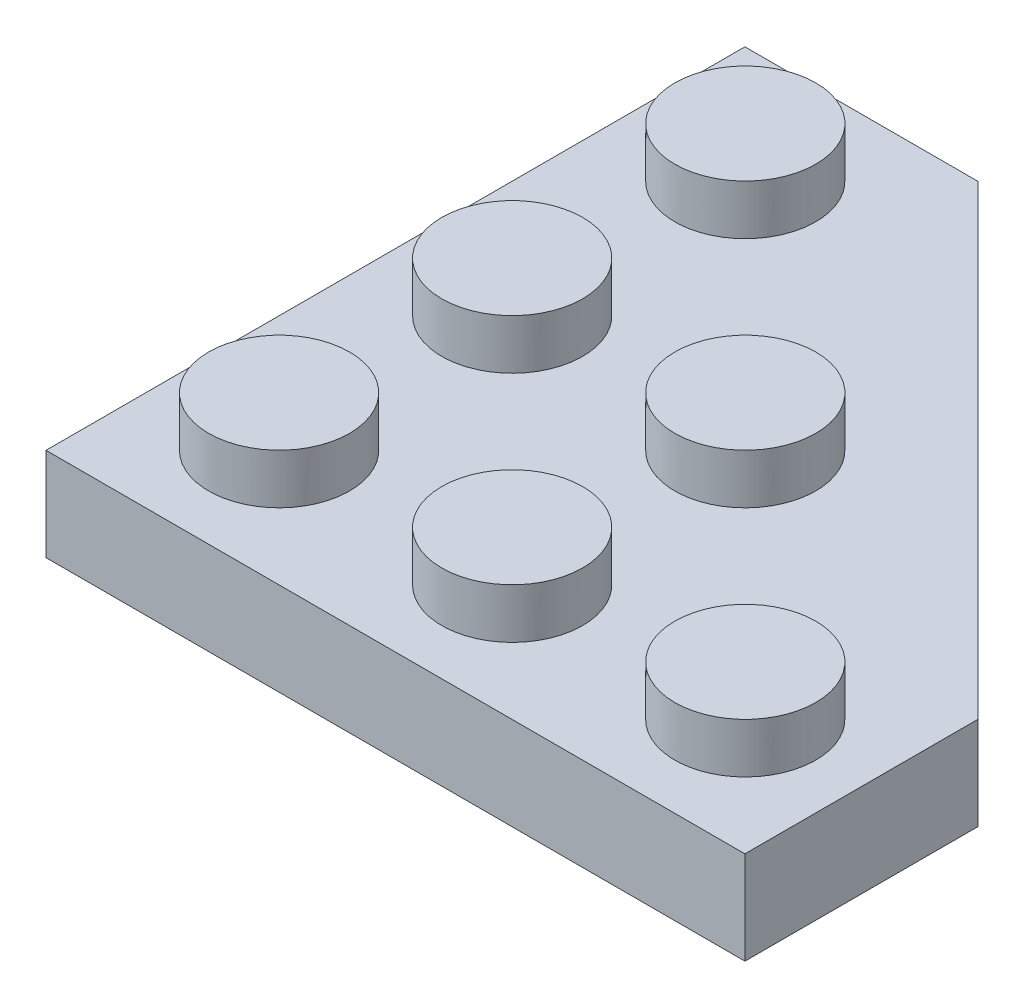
ISO-10303-21;
HEADER;
FILE_DESCRIPTION(('STEP AP214'),'2;1');
FILE_NAME('part.step','',(''),(''),'','','');
FILE_SCHEMA(('AUTOMOTIVE_DESIGN { 1 0 10303 214 1 1 1 1 }'));
ENDSEC;
DATA;
#1=APPLICATION_CONTEXT('core data for automotive mechanical design processes');
#2=APPLICATION_PROTOCOL_DEFINITION('international standard','automotive_design',2000,#1);
#3=PRODUCT_CONTEXT('',#1,'mechanical');
#4=PRODUCT('Part','Part','',(#3));
#5=PRODUCT_RELATED_PRODUCT_CATEGORY('part','',(#4));
#6=PRODUCT_DEFINITION_FORMATION('','',#4);
#7=PRODUCT_DEFINITION_CONTEXT('part definition',#1,'design');
#8=PRODUCT_DEFINITION('design','',#6,#7);
#9=PRODUCT_DEFINITION_SHAPE('','',#8);
#10=(LENGTH_UNIT() NAMED_UNIT(*) SI_UNIT(.MILLI.,.METRE.));
#11=(NAMED_UNIT(*) PLANE_ANGLE_UNIT() SI_UNIT($,.RADIAN.));
#12=(NAMED_UNIT(*) SI_UNIT($,.STERADIAN.) SOLID_ANGLE_UNIT());
#13=UNCERTAINTY_MEASURE_WITH_UNIT(LENGTH_MEASURE(1.E-05),#10,'distance_accuracy_value','');
#14=(GEOMETRIC_REPRESENTATION_CONTEXT(3) GLOBAL_UNCERTAINTY_ASSIGNED_CONTEXT((#13)) GLOBAL_UNIT_ASSIGNED_CONTEXT((#10,
#11,#12)) REPRESENTATION_CONTEXT('',''));
#15=CARTESIAN_POINT('',(0.,0.,0.));
#16=DIRECTION('',(0.,0.,1.));
#17=DIRECTION('',(1.,0.,0.));
#18=AXIS2_PLACEMENT_3D('',#15,#16,#17);
#19=CARTESIAN_POINT('',(10.7774679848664,0.,5.08503201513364));
#20=DIRECTION('',(0.707106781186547,0.,-0.707106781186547));
#21=DIRECTION('',(-0.707106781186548,0.,-0.707106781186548));
#22=AXIS2_PLACEMENT_3D('',#19,#20,#21);
#23=PLANE('',#22);
#24=DIRECTION('',(0.,1.,0.));
#25=VECTOR('',#24,1.);
#26=CARTESIAN_POINT('',(2.49266459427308,4.867,-3.19977137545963));
#27=LINE('',#26,#25);
#28=CARTESIAN_POINT('',(2.49266459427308,0.,-3.19977137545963));
#29=VERTEX_POINT('',#28);
#30=CARTESIAN_POINT('',(2.49266459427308,1.5785,-3.19977137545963));
#31=VERTEX_POINT('',#30);
#32=EDGE_CURVE('E187',#29,#31,#27,.T.);
#33=ORIENTED_EDGE('',*,*,#32,.T.);
#34=DIRECTION('',(-0.707106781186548,0.,-0.707106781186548));
#35=VECTOR('',#34,1.);
#36=CARTESIAN_POINT('',(10.7774679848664,1.5785,5.08503201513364));
#37=LINE('',#36,#35);
#38=CARTESIAN_POINT('',(0.152141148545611,1.5785,-5.5402948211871));
#39=VERTEX_POINT('',#38);
#40=EDGE_CURVE('E62',#31,#39,#37,.T.);
#41=ORIENTED_EDGE('',*,*,#40,.T.);
#42=DIRECTION('',(0.,-1.,0.));
#43=VECTOR('',#42,1.);
#44=CARTESIAN_POINT('',(0.152141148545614,7.992,-5.5402948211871));
#45=LINE('',#44,#43);
#46=CARTESIAN_POINT('',(0.152141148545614,0.,-5.5402948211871));
#47=VERTEX_POINT('',#46);
#48=EDGE_CURVE('E209',#39,#47,#45,.T.);
#49=ORIENTED_EDGE('',*,*,#48,.T.);
#50=DIRECTION('',(-0.707106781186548,0.,-0.707106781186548));
#51=VECTOR('',#50,1.);
#52=CARTESIAN_POINT('',(10.7774679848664,0.,5.08503201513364));
#53=LINE('',#52,#51);
#54=EDGE_CURVE('E202',#29,#47,#53,.T.);
#55=ORIENTED_EDGE('',*,*,#54,.F.);
#56=EDGE_LOOP('',(#33,#41,#49,#55));
#57=FACE_BOUND('',#56,.T.);
#58=ADVANCED_FACE('F39',(#57),#23,.F.);
#59=CARTESIAN_POINT('',(-11.9,0.,11.9));
#60=DIRECTION('',(0.,-1.,0.));
#61=DIRECTION('',(0.,0.,-1.));
#62=AXIS2_PLACEMENT_3D('',#59,#60,#61);
#63=PLANE('',#62);
#64=CARTESIAN_POINT('',(5.5402948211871,0.,-0.15214114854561));
#65=VERTEX_POINT('',#64);
#66=CARTESIAN_POINT('',(3.19977137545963,0.,-2.49266459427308));
#67=VERTEX_POINT('',#66);
#68=EDGE_CURVE('E210',#65,#67,#53,.T.);
#69=ORIENTED_EDGE('',*,*,#68,.T.);
#70=DIRECTION('',(-0.707106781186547,0.,0.707106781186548));
#71=VECTOR('',#70,1.);
#72=CARTESIAN_POINT('',(3.24168091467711,0.,-2.53457413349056));
#73=LINE('',#72,#71);
#74=CARTESIAN_POINT('',(2.34365530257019,0.,-1.63654852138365));
#75=VERTEX_POINT('',#74);
#76=EDGE_CURVE('E1054',#67,#75,#73,.T.);
#77=ORIENTED_EDGE('',*,*,#76,.T.);
#78=DIRECTION('',(-0.707106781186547,0.,-0.707106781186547));
#79=VECTOR('',#78,1.);
#80=CARTESIAN_POINT('',(2.34365530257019,0.,-1.63654852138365));
#81=LINE('',#80,#79);
#82=CARTESIAN_POINT('',(1.63654852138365,0.,-2.3436553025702));
#83=VERTEX_POINT('',#82);
#84=EDGE_CURVE('E206',#75,#83,#81,.T.);
#85=ORIENTED_EDGE('',*,*,#84,.T.);
#86=DIRECTION('',(-0.707106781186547,0.,0.707106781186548));
#87=VECTOR('',#86,1.);
#88=CARTESIAN_POINT('',(2.53457413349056,0.,-3.24168091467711));
#89=LINE('',#88,#87);
#90=EDGE_CURVE('E190',#29,#83,#89,.T.);
#91=ORIENTED_EDGE('',*,*,#90,.F.);
#92=ORIENTED_EDGE('',*,*,#54,.T.);
#93=DIRECTION('',(0.707106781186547,0.,-0.707106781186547));
#94=VECTOR('',#93,1.);
#95=CARTESIAN_POINT('',(0.152141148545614,0.,-5.5402948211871));
#96=LINE('',#95,#94);
#97=CARTESIAN_POINT('',(1.27467316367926,0.,-6.66282683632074));
#98=VERTEX_POINT('',#97);
#99=EDGE_CURVE('E1026',#47,#98,#96,.T.);
#100=ORIENTED_EDGE('',*,*,#99,.T.);
#101=DIRECTION('',(-0.707106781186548,0.,-0.707106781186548));
#102=VECTOR('',#101,1.);
#103=CARTESIAN_POINT('',(11.9,0.,3.9625));
#104=LINE('',#103,#102);
#105=CARTESIAN_POINT('',(6.66282683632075,0.,-1.27467316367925));
#106=VERTEX_POINT('',#105);
#107=EDGE_CURVE('E507',#106,#98,#104,.T.);
#108=ORIENTED_EDGE('',*,*,#107,.F.);
#109=DIRECTION('',(0.707106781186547,0.,-0.707106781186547));
#110=VECTOR('',#109,1.);
#111=CARTESIAN_POINT('',(5.5402948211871,0.,-0.15214114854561));
#112=LINE('',#111,#110);
#113=EDGE_CURVE('E1036',#65,#106,#112,.T.);
#114=ORIENTED_EDGE('',*,*,#113,.F.);
#115=EDGE_LOOP('',(#69,#77,#85,#91,#92,#100,#108,#114));
#116=FACE_BOUND('',#115,.T.);
#117=ADVANCED_FACE('F200',(#116),#63,.T.);
#118=CARTESIAN_POINT('',(-2.13782416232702,0.,-10.075324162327));
#119=VERTEX_POINT('',#118);
#120=CARTESIAN_POINT('',(-3.9625,0.,-11.9));
#121=VERTEX_POINT('',#120);
#122=EDGE_CURVE('E505',#119,#121,#104,.T.);
#123=ORIENTED_EDGE('',*,*,#122,.F.);
#124=DIRECTION('',(-0.707106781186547,0.,0.707106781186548));
#125=VECTOR('',#124,1.);
#126=CARTESIAN_POINT('',(-2.13782416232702,0.,-10.075324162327));
#127=LINE('',#126,#125);
#128=CARTESIAN_POINT('',(-3.26035617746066,0.,-8.95279214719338));
#129=VERTEX_POINT('',#128);
#130=EDGE_CURVE('E1024',#119,#129,#127,.T.);
#131=ORIENTED_EDGE('',*,*,#130,.T.);
#132=CARTESIAN_POINT('',(-4.62006403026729,0.,-10.3125));
#133=VERTEX_POINT('',#132);
#134=EDGE_CURVE('E211',#129,#133,#53,.T.);
#135=ORIENTED_EDGE('',*,*,#134,.T.);
#136=DIRECTION('',(1.,0.,0.));
#137=VECTOR('',#136,1.);
#138=CARTESIAN_POINT('',(-11.9,0.,-10.3125));
#139=LINE('',#138,#137);
#140=CARTESIAN_POINT('',(-10.3125,0.,-10.3125));
#141=VERTEX_POINT('',#140);
#142=EDGE_CURVE('E262',#141,#133,#139,.T.);
#143=ORIENTED_EDGE('',*,*,#142,.F.);
#144=DIRECTION('',(0.,0.,1.));
#145=VECTOR('',#144,1.);
#146=CARTESIAN_POINT('',(-10.3125,0.,11.9));
#147=LINE('',#146,#145);
#148=CARTESIAN_POINT('',(-10.3125,0.,10.3125));
#149=VERTEX_POINT('',#148);
#150=EDGE_CURVE('E241',#141,#149,#147,.T.);
#151=ORIENTED_EDGE('',*,*,#150,.T.);
#152=DIRECTION('',(-1.,0.,0.));
#153=VECTOR('',#152,1.);
#154=CARTESIAN_POINT('',(-11.9,0.,10.3125));
#155=LINE('',#154,#153);
#156=CARTESIAN_POINT('',(10.3125,0.,10.3125));
#157=VERTEX_POINT('',#156);
#158=EDGE_CURVE('E263',#157,#149,#155,.T.);
#159=ORIENTED_EDGE('',*,*,#158,.F.);
#160=DIRECTION('',(0.,0.,-1.));
#161=VECTOR('',#160,1.);
#162=CARTESIAN_POINT('',(10.3125,0.,11.9));
#163=LINE('',#162,#161);
#164=CARTESIAN_POINT('',(10.3125,0.,4.62006403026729));
#165=VERTEX_POINT('',#164);
#166=EDGE_CURVE('E260',#157,#165,#163,.T.);
#167=ORIENTED_EDGE('',*,*,#166,.T.);
#168=CARTESIAN_POINT('',(8.95279214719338,0.,3.26035617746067));
#169=VERTEX_POINT('',#168);
#170=EDGE_CURVE('E213',#165,#169,#53,.T.);
#171=ORIENTED_EDGE('',*,*,#170,.T.);
#172=DIRECTION('',(-0.707106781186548,0.,0.707106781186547));
#173=VECTOR('',#172,1.);
#174=CARTESIAN_POINT('',(10.075324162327,0.,2.13782416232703));
#175=LINE('',#174,#173);
#176=CARTESIAN_POINT('',(10.075324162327,0.,2.13782416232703));
#177=VERTEX_POINT('',#176);
#178=EDGE_CURVE('E988',#177,#169,#175,.T.);
#179=ORIENTED_EDGE('',*,*,#178,.F.);
#180=CARTESIAN_POINT('',(11.9,0.,3.96250000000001));
#181=VERTEX_POINT('',#180);
#182=EDGE_CURVE('E503',#181,#177,#104,.T.);
#183=ORIENTED_EDGE('',*,*,#182,.F.);
#184=DIRECTION('',(0.,0.,-1.));
#185=VECTOR('',#184,1.);
#186=CARTESIAN_POINT('',(11.9,0.,11.9));
#187=LINE('',#186,#185);
#188=CARTESIAN_POINT('',(11.9,0.,11.9));
#189=VERTEX_POINT('',#188);
#190=EDGE_CURVE('E471',#189,#181,#187,.T.);
#191=ORIENTED_EDGE('',*,*,#190,.F.);
#192=DIRECTION('',(-1.,0.,0.));
#193=VECTOR('',#192,1.);
#194=CARTESIAN_POINT('',(11.9,0.,11.9));
#195=LINE('',#194,#193);
#196=CARTESIAN_POINT('',(-11.9,0.,11.9));
#197=VERTEX_POINT('',#196);
#198=EDGE_CURVE('E474',#189,#197,#195,.T.);
#199=ORIENTED_EDGE('',*,*,#198,.T.);
#200=DIRECTION('',(0.,0.,1.));
#201=VECTOR('',#200,1.);
#202=CARTESIAN_POINT('',(-11.9,0.,-11.9));
#203=LINE('',#202,#201);
#204=CARTESIAN_POINT('',(-11.9,0.,-11.9));
#205=VERTEX_POINT('',#204);
#206=EDGE_CURVE('E477',#205,#197,#203,.T.);
#207=ORIENTED_EDGE('',*,*,#206,.F.);
#208=DIRECTION('',(1.,0.,0.));
#209=VECTOR('',#208,1.);
#210=CARTESIAN_POINT('',(-11.9,0.,-11.9));
#211=LINE('',#210,#209);
#212=EDGE_CURVE('E467',#205,#121,#211,.T.);
#213=ORIENTED_EDGE('',*,*,#212,.T.);
#214=EDGE_LOOP('',(#123,#131,#135,#143,#151,#159,#167,#171,#179,#183,#191,#199,#207,#213));
#215=FACE_BOUND('',#214,.T.);
#216=ADVANCED_FACE('F361',(#215),#63,.T.);
#217=CARTESIAN_POINT('',(11.9,0.,3.9625));
#218=DIRECTION('',(0.707106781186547,0.,-0.707106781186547));
#219=DIRECTION('',(-0.707106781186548,0.,-0.707106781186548));
#220=AXIS2_PLACEMENT_3D('',#217,#218,#219);
#221=PLANE('',#220);
#222=ORIENTED_EDGE('',*,*,#107,.T.);
#223=DIRECTION('',(0.,-1.,0.));
#224=VECTOR('',#223,1.);
#225=CARTESIAN_POINT('',(1.27467316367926,7.992,-6.66282683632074));
#226=LINE('',#225,#224);
#227=CARTESIAN_POINT('',(1.27467316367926,1.5785,-6.66282683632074));
#228=VERTEX_POINT('',#227);
#229=EDGE_CURVE('E1040',#228,#98,#226,.T.);
#230=ORIENTED_EDGE('',*,*,#229,.F.);
#231=DIRECTION('',(0.707106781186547,0.,0.707106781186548));
#232=VECTOR('',#231,1.);
#233=CARTESIAN_POINT('',(1.27467316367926,1.5785,-6.66282683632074));
#234=LINE('',#233,#232);
#235=CARTESIAN_POINT('',(-2.13782416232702,1.5785,-10.075324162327));
#236=VERTEX_POINT('',#235);
#237=EDGE_CURVE('E1035',#236,#228,#234,.T.);
#238=ORIENTED_EDGE('',*,*,#237,.F.);
#239=DIRECTION('',(0.,-1.,0.));
#240=VECTOR('',#239,1.);
#241=CARTESIAN_POINT('',(-2.13782416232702,7.992,-10.075324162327));
#242=LINE('',#241,#240);
#243=EDGE_CURVE('E516',#236,#119,#242,.T.);
#244=ORIENTED_EDGE('',*,*,#243,.T.);
#245=ORIENTED_EDGE('',*,*,#122,.T.);
#246=DIRECTION('',(0.,1.,0.));
#247=VECTOR('',#246,1.);
#248=CARTESIAN_POINT('',(-3.9625,0.,-11.9));
#249=LINE('',#248,#247);
#250=CARTESIAN_POINT('',(-3.9625,3.166,-11.9));
#251=VERTEX_POINT('',#250);
#252=EDGE_CURVE('E501',#121,#251,#249,.T.);
#253=ORIENTED_EDGE('',*,*,#252,.T.);
#254=DIRECTION('',(-0.707106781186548,0.,-0.707106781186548));
#255=VECTOR('',#254,1.);
#256=CARTESIAN_POINT('',(11.9,3.166,3.9625));
#257=LINE('',#256,#255);
#258=CARTESIAN_POINT('',(11.9,3.166,3.9625));
#259=VERTEX_POINT('',#258);
#260=EDGE_CURVE('E259',#259,#251,#257,.T.);
#261=ORIENTED_EDGE('',*,*,#260,.F.);
#262=DIRECTION('',(0.,1.,0.));
#263=VECTOR('',#262,1.);
#264=CARTESIAN_POINT('',(11.9,0.,3.9625));
#265=LINE('',#264,#263);
#266=EDGE_CURVE('E498',#181,#259,#265,.T.);
#267=ORIENTED_EDGE('',*,*,#266,.F.);
#268=ORIENTED_EDGE('',*,*,#182,.T.);
#269=DIRECTION('',(0.,-1.,0.));
#270=VECTOR('',#269,1.);
#271=CARTESIAN_POINT('',(10.075324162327,7.992,2.13782416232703));
#272=LINE('',#271,#270);
#273=CARTESIAN_POINT('',(10.075324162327,1.5785,2.13782416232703));
#274=VERTEX_POINT('',#273);
#275=EDGE_CURVE('E970',#274,#177,#272,.T.);
#276=ORIENTED_EDGE('',*,*,#275,.F.);
#277=DIRECTION('',(-0.707106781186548,0.,-0.707106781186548));
#278=VECTOR('',#277,1.);
#279=CARTESIAN_POINT('',(6.66282683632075,1.5785,-1.27467316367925));
#280=LINE('',#279,#278);
#281=CARTESIAN_POINT('',(6.66282683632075,1.5785,-1.27467316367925));
#282=VERTEX_POINT('',#281);
#283=EDGE_CURVE('E973',#274,#282,#280,.T.);
#284=ORIENTED_EDGE('',*,*,#283,.T.);
#285=DIRECTION('',(0.,-1.,0.));
#286=VECTOR('',#285,1.);
#287=CARTESIAN_POINT('',(6.66282683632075,7.992,-1.27467316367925));
#288=LINE('',#287,#286);
#289=EDGE_CURVE('E980',#282,#106,#288,.T.);
#290=ORIENTED_EDGE('',*,*,#289,.T.);
#291=EDGE_LOOP('',(#222,#230,#238,#244,#245,#253,#261,#267,#268,#276,#284,#290));
#292=FACE_BOUND('',#291,.T.);
#293=ADVANCED_FACE('F368',(#292),#221,.T.);
#294=CARTESIAN_POINT('',(5.5402948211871,1.5785,-0.152141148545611));
#295=VERTEX_POINT('',#294);
#296=CARTESIAN_POINT('',(3.19977137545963,1.5785,-2.49266459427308));
#297=VERTEX_POINT('',#296);
#298=EDGE_CURVE('E298',#295,#297,#37,.T.);
#299=ORIENTED_EDGE('',*,*,#298,.T.);
#300=DIRECTION('',(0.,1.,0.));
#301=VECTOR('',#300,1.);
#302=CARTESIAN_POINT('',(3.19977137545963,4.867,-2.49266459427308));
#303=LINE('',#302,#301);
#304=EDGE_CURVE('E196',#67,#297,#303,.T.);
#305=ORIENTED_EDGE('',*,*,#304,.F.);
#306=ORIENTED_EDGE('',*,*,#68,.F.);
#307=DIRECTION('',(0.,-1.,0.));
#308=VECTOR('',#307,1.);
#309=CARTESIAN_POINT('',(5.5402948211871,7.992,-0.15214114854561));
#310=LINE('',#309,#308);
#311=EDGE_CURVE('E983',#295,#65,#310,.T.);
#312=ORIENTED_EDGE('',*,*,#311,.F.);
#313=EDGE_LOOP('',(#299,#305,#306,#312));
#314=FACE_BOUND('',#313,.T.);
#315=ADVANCED_FACE('F357',(#314),#23,.F.);
#316=DIRECTION('',(0.,-1.,0.));
#317=VECTOR('',#316,1.);
#318=CARTESIAN_POINT('',(-3.26035617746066,7.992,-8.95279214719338));
#319=LINE('',#318,#317);
#320=CARTESIAN_POINT('',(-3.26035617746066,1.5785,-8.95279214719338));
#321=VERTEX_POINT('',#320);
#322=EDGE_CURVE('E1043',#321,#129,#319,.T.);
#323=ORIENTED_EDGE('',*,*,#322,.F.);
#324=CARTESIAN_POINT('',(-4.62006403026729,1.5785,-10.3125));
#325=VERTEX_POINT('',#324);
#326=EDGE_CURVE('E302',#321,#325,#37,.T.);
#327=ORIENTED_EDGE('',*,*,#326,.T.);
#328=DIRECTION('',(0.,1.,0.));
#329=VECTOR('',#328,1.);
#330=CARTESIAN_POINT('',(-4.62006403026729,0.,-10.3125));
#331=LINE('',#330,#329);
#332=EDGE_CURVE('E218',#133,#325,#331,.T.);
#333=ORIENTED_EDGE('',*,*,#332,.F.);
#334=ORIENTED_EDGE('',*,*,#134,.F.);
#335=EDGE_LOOP('',(#323,#327,#333,#334));
#336=FACE_BOUND('',#335,.T.);
#337=ADVANCED_FACE('F356',(#336),#23,.F.);
#338=CARTESIAN_POINT('',(10.3125,1.5785,4.62006403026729));
#339=VERTEX_POINT('',#338);
#340=CARTESIAN_POINT('',(8.95279214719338,1.5785,3.26035617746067));
#341=VERTEX_POINT('',#340);
#342=EDGE_CURVE('E214',#339,#341,#37,.T.);
#343=ORIENTED_EDGE('',*,*,#342,.T.);
#344=DIRECTION('',(0.,-1.,0.));
#345=VECTOR('',#344,1.);
#346=CARTESIAN_POINT('',(8.95279214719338,7.992,3.26035617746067));
#347=LINE('',#346,#345);
#348=EDGE_CURVE('E971',#341,#169,#347,.T.);
#349=ORIENTED_EDGE('',*,*,#348,.T.);
#350=ORIENTED_EDGE('',*,*,#170,.F.);
#351=DIRECTION('',(0.,1.,0.));
#352=VECTOR('',#351,1.);
#353=CARTESIAN_POINT('',(10.3125,0.,4.62006403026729));
#354=LINE('',#353,#352);
#355=EDGE_CURVE('E224',#165,#339,#354,.T.);
#356=ORIENTED_EDGE('',*,*,#355,.T.);
#357=EDGE_LOOP('',(#343,#349,#350,#356));
#358=FACE_BOUND('',#357,.T.);
#359=ADVANCED_FACE('F366',(#358),#23,.F.);
#360=CARTESIAN_POINT('',(-11.9,1.5785,11.9));
#361=DIRECTION('',(0.,-1.,0.));
#362=DIRECTION('',(0.,0.,-1.));
#363=AXIS2_PLACEMENT_3D('',#360,#361,#362);
#364=PLANE('',#363);
#365=DIRECTION('',(0.707106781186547,0.,-0.707106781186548));
#366=VECTOR('',#365,1.);
#367=CARTESIAN_POINT('',(3.24168091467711,1.5785,-2.53457413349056));
#368=LINE('',#367,#366);
#369=CARTESIAN_POINT('',(2.34365530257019,1.5785,-1.63654852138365));
#370=VERTEX_POINT('',#369);
#371=EDGE_CURVE('E1022',#370,#297,#368,.T.);
#372=ORIENTED_EDGE('',*,*,#371,.T.);
#373=ORIENTED_EDGE('',*,*,#298,.F.);
#374=DIRECTION('',(-0.707106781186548,0.,0.707106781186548));
#375=VECTOR('',#374,1.);
#376=CARTESIAN_POINT('',(5.5402948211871,1.5785,-0.15214114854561));
#377=LINE('',#376,#375);
#378=EDGE_CURVE('E972',#282,#295,#377,.T.);
#379=ORIENTED_EDGE('',*,*,#378,.F.);
#380=ORIENTED_EDGE('',*,*,#283,.F.);
#381=DIRECTION('',(0.707106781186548,0.,-0.707106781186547));
#382=VECTOR('',#381,1.);
#383=CARTESIAN_POINT('',(10.075324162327,1.5785,2.13782416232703));
#384=LINE('',#383,#382);
#385=EDGE_CURVE('E968',#341,#274,#384,.T.);
#386=ORIENTED_EDGE('',*,*,#385,.F.);
#387=ORIENTED_EDGE('',*,*,#342,.F.);
#388=DIRECTION('',(0.,0.,-1.));
#389=VECTOR('',#388,1.);
#390=CARTESIAN_POINT('',(10.3125,1.5785,11.9));
#391=LINE('',#390,#389);
#392=CARTESIAN_POINT('',(10.3125,1.5785,10.3125));
#393=VERTEX_POINT('',#392);
#394=EDGE_CURVE('E275',#393,#339,#391,.T.);
#395=ORIENTED_EDGE('',*,*,#394,.F.);
#396=DIRECTION('',(-1.,0.,0.));
#397=VECTOR('',#396,1.);
#398=CARTESIAN_POINT('',(-11.9,1.5785,10.3125));
#399=LINE('',#398,#397);
#400=CARTESIAN_POINT('',(-10.3125,1.5785,10.3125));
#401=VERTEX_POINT('',#400);
#402=EDGE_CURVE('E268',#393,#401,#399,.T.);
#403=ORIENTED_EDGE('',*,*,#402,.T.);
#404=DIRECTION('',(0.,0.,1.));
#405=VECTOR('',#404,1.);
#406=CARTESIAN_POINT('',(-10.3125,1.5785,11.9));
#407=LINE('',#406,#405);
#408=CARTESIAN_POINT('',(-10.3125,1.5785,-10.3125));
#409=VERTEX_POINT('',#408);
#410=EDGE_CURVE('E266',#409,#401,#407,.T.);
#411=ORIENTED_EDGE('',*,*,#410,.F.);
#412=DIRECTION('',(1.,0.,0.));
#413=VECTOR('',#412,1.);
#414=CARTESIAN_POINT('',(-11.9,1.5785,-10.3125));
#415=LINE('',#414,#413);
#416=EDGE_CURVE('E278',#409,#325,#415,.T.);
#417=ORIENTED_EDGE('',*,*,#416,.T.);
#418=ORIENTED_EDGE('',*,*,#326,.F.);
#419=DIRECTION('',(0.707106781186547,0.,-0.707106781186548));
#420=VECTOR('',#419,1.);
#421=CARTESIAN_POINT('',(-2.13782416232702,1.5785,-10.075324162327));
#422=LINE('',#421,#420);
#423=EDGE_CURVE('E1034',#321,#236,#422,.T.);
#424=ORIENTED_EDGE('',*,*,#423,.T.);
#425=ORIENTED_EDGE('',*,*,#237,.T.);
#426=DIRECTION('',(-0.707106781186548,0.,0.707106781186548));
#427=VECTOR('',#426,1.);
#428=CARTESIAN_POINT('',(0.152141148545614,1.5785,-5.5402948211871));
#429=LINE('',#428,#427);
#430=EDGE_CURVE('E1032',#228,#39,#429,.T.);
#431=ORIENTED_EDGE('',*,*,#430,.T.);
#432=ORIENTED_EDGE('',*,*,#40,.F.);
#433=DIRECTION('',(0.707106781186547,0.,-0.707106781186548));
#434=VECTOR('',#433,1.);
#435=CARTESIAN_POINT('',(2.53457413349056,1.5785,-3.24168091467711));
#436=LINE('',#435,#434);
#437=CARTESIAN_POINT('',(1.63654852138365,1.5785,-2.34365530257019));
#438=VERTEX_POINT('',#437);
#439=EDGE_CURVE('E193',#438,#31,#436,.T.);
#440=ORIENTED_EDGE('',*,*,#439,.F.);
#441=DIRECTION('',(0.707106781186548,0.,0.707106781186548));
#442=VECTOR('',#441,1.);
#443=CARTESIAN_POINT('',(2.34365530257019,1.5785,-1.63654852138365));
#444=LINE('',#443,#442);
#445=EDGE_CURVE('E195',#438,#370,#444,.T.);
#446=ORIENTED_EDGE('',*,*,#445,.T.);
#447=EDGE_LOOP('',(#372,#373,#379,#380,#386,#387,#395,#403,#411,#417,#418,#424,#425,#431,#432,
#440,#446));
#448=FACE_BOUND('',#447,.T.);
#449=CARTESIAN_POINT('',(-7.93125,1.5785,-7.94375));
#450=DIRECTION('',(0.,-1.,0.));
#451=DIRECTION('',(0.,0.,-1.));
#452=AXIS2_PLACEMENT_3D('',#449,#450,#451);
#453=CIRCLE('',#452,0.812499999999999);
#454=CARTESIAN_POINT('',(-7.93125,1.5785,-8.75625));
#455=VERTEX_POINT('',#454);
#456=EDGE_CURVE('E255',#455,#455,#453,.F.);
#457=ORIENTED_EDGE('',*,*,#456,.T.);
#458=EDGE_LOOP('',(#457));
#459=FACE_BOUND('',#458,.T.);
#460=CARTESIAN_POINT('',(-7.93125,1.5785,-0.00624999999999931));
#461=DIRECTION('',(0.,-1.,0.));
#462=DIRECTION('',(0.,0.,-1.));
#463=AXIS2_PLACEMENT_3D('',#460,#461,#462);
#464=CIRCLE('',#463,0.812499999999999);
#465=CARTESIAN_POINT('',(-7.93125,1.5785,-0.818749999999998));
#466=VERTEX_POINT('',#465);
#467=EDGE_CURVE('E250',#466,#466,#464,.F.);
#468=ORIENTED_EDGE('',*,*,#467,.T.);
#469=EDGE_LOOP('',(#468));
#470=FACE_BOUND('',#469,.T.);
#471=CARTESIAN_POINT('',(7.94375,1.5785,7.93125));
#472=DIRECTION('',(0.,-1.,0.));
#473=DIRECTION('',(0.,0.,-1.));
#474=AXIS2_PLACEMENT_3D('',#471,#472,#473);
#475=CIRCLE('',#474,0.812499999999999);
#476=CARTESIAN_POINT('',(7.94375,1.5785,7.11875));
#477=VERTEX_POINT('',#476);
#478=EDGE_CURVE('E251',#477,#477,#475,.F.);
#479=ORIENTED_EDGE('',*,*,#478,.T.);
#480=EDGE_LOOP('',(#479));
#481=FACE_BOUND('',#480,.T.);
#482=CARTESIAN_POINT('',(0.00624999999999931,1.5785,7.93125));
#483=DIRECTION('',(0.,-1.,0.));
#484=DIRECTION('',(0.,0.,-1.));
#485=AXIS2_PLACEMENT_3D('',#482,#483,#484);
#486=CIRCLE('',#485,0.812499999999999);
#487=CARTESIAN_POINT('',(0.00624999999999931,1.5785,7.11875));
#488=VERTEX_POINT('',#487);
#489=EDGE_CURVE('E293',#488,#488,#486,.F.);
#490=ORIENTED_EDGE('',*,*,#489,.T.);
#491=EDGE_LOOP('',(#490));
#492=FACE_BOUND('',#491,.T.);
#493=CARTESIAN_POINT('',(-7.93125,1.5785,7.93125));
#494=DIRECTION('',(0.,-1.,0.));
#495=DIRECTION('',(0.,0.,-1.));
#496=AXIS2_PLACEMENT_3D('',#493,#494,#495);
#497=CIRCLE('',#496,0.812499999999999);
#498=CARTESIAN_POINT('',(-7.93125,1.5785,7.11875));
#499=VERTEX_POINT('',#498);
#500=EDGE_CURVE('E285',#499,#499,#497,.F.);
#501=ORIENTED_EDGE('',*,*,#500,.T.);
#502=EDGE_LOOP('',(#501));
#503=FACE_BOUND('',#502,.T.);
#504=CARTESIAN_POINT('',(0.00624999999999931,1.5785,-0.00624999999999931));
#505=DIRECTION('',(0.,-1.,0.));
#506=DIRECTION('',(0.,0.,-1.));
#507=AXIS2_PLACEMENT_3D('',#504,#505,#506);
#508=CIRCLE('',#507,0.812499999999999);
#509=CARTESIAN_POINT('',(0.00624999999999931,1.5785,-0.818749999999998));
#510=VERTEX_POINT('',#509);
#511=EDGE_CURVE('E288',#510,#510,#508,.F.);
#512=ORIENTED_EDGE('',*,*,#511,.T.);
#513=EDGE_LOOP('',(#512));
#514=FACE_BOUND('',#513,.T.);
#515=CARTESIAN_POINT('',(-3.965625,1.5785,-3.971875));
#516=DIRECTION('',(0.,-1.,0.));
#517=DIRECTION('',(1.,0.,0.));
#518=AXIS2_PLACEMENT_3D('',#515,#516,#517);
#519=CIRCLE('',#518,3.2004);
#520=CARTESIAN_POINT('',(-0.765225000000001,1.5785,-3.971875));
#521=VERTEX_POINT('',#520);
#522=EDGE_CURVE('E308',#521,#521,#519,.T.);
#523=ORIENTED_EDGE('',*,*,#522,.F.);
#524=EDGE_LOOP('',(#523));
#525=FACE_BOUND('',#524,.T.);
#526=CARTESIAN_POINT('',(-3.9625,1.57850000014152,3.9625));
#527=DIRECTION('',(0.,-1.,0.));
#528=DIRECTION('',(1.,0.,0.));
#529=AXIS2_PLACEMENT_3D('',#526,#527,#528);
#530=CIRCLE('',#529,3.2004);
#531=CARTESIAN_POINT('',(-3.9625,1.57850000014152,7.1629));
#532=VERTEX_POINT('',#531);
#533=EDGE_CURVE('E1000',#532,#532,#530,.T.);
#534=ORIENTED_EDGE('',*,*,#533,.F.);
#535=EDGE_LOOP('',(#534));
#536=FACE_BOUND('',#535,.T.);
#537=CARTESIAN_POINT('',(3.971875,1.57850000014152,3.965625));
#538=DIRECTION('',(0.,-1.,0.));
#539=DIRECTION('',(1.,0.,0.));
#540=AXIS2_PLACEMENT_3D('',#537,#538,#539);
#541=CIRCLE('',#540,3.2004);
#542=CARTESIAN_POINT('',(3.971875,1.57850000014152,7.166025));
#543=VERTEX_POINT('',#542);
#544=EDGE_CURVE('E994',#543,#543,#541,.T.);
#545=ORIENTED_EDGE('',*,*,#544,.F.);
#546=EDGE_LOOP('',(#545));
#547=FACE_BOUND('',#546,.T.);
#548=ADVANCED_FACE('F331',(#448,#459,#470,#481,#492,#503,#514,#525,#536,#547),#364,.T.);
#549=CARTESIAN_POINT('',(-11.9,3.166,11.9));
#550=DIRECTION('',(0.,-1.,0.));
#551=DIRECTION('',(0.,0.,-1.));
#552=AXIS2_PLACEMENT_3D('',#549,#550,#551);
#553=PLANE('',#552);
#554=CARTESIAN_POINT('',(-7.93125,3.166,-7.94375));
#555=DIRECTION('',(0.,-1.,0.));
#556=DIRECTION('',(0.,0.,-1.));
#557=AXIS2_PLACEMENT_3D('',#554,#555,#556);
#558=CIRCLE('',#557,2.4);
#559=CARTESIAN_POINT('',(-7.93125,3.166,-10.34375));
#560=VERTEX_POINT('',#559);
#561=EDGE_CURVE('E436',#560,#560,#558,.F.);
#562=ORIENTED_EDGE('',*,*,#561,.F.);
#563=EDGE_LOOP('',(#562));
#564=FACE_BOUND('',#563,.T.);
#565=CARTESIAN_POINT('',(-7.93125,3.166,-0.00624999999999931));
#566=DIRECTION('',(0.,-1.,0.));
#567=DIRECTION('',(0.,0.,-1.));
#568=AXIS2_PLACEMENT_3D('',#565,#566,#567);
#569=CIRCLE('',#568,2.4);
#570=CARTESIAN_POINT('',(-7.93125,3.166,-2.40625));
#571=VERTEX_POINT('',#570);
#572=EDGE_CURVE('E442',#571,#571,#569,.F.);
#573=ORIENTED_EDGE('',*,*,#572,.F.);
#574=EDGE_LOOP('',(#573));
#575=FACE_BOUND('',#574,.T.);
#576=CARTESIAN_POINT('',(7.94375,3.166,7.93125));
#577=DIRECTION('',(0.,-1.,0.));
#578=DIRECTION('',(0.,0.,-1.));
#579=AXIS2_PLACEMENT_3D('',#576,#577,#578);
#580=CIRCLE('',#579,2.4);
#581=CARTESIAN_POINT('',(7.94375,3.166,5.53125));
#582=VERTEX_POINT('',#581);
#583=EDGE_CURVE('E448',#582,#582,#580,.F.);
#584=ORIENTED_EDGE('',*,*,#583,.F.);
#585=EDGE_LOOP('',(#584));
#586=FACE_BOUND('',#585,.T.);
#587=CARTESIAN_POINT('',(0.00624999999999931,3.166,7.93125));
#588=DIRECTION('',(0.,-1.,0.));
#589=DIRECTION('',(0.,0.,-1.));
#590=AXIS2_PLACEMENT_3D('',#587,#588,#589);
#591=CIRCLE('',#590,2.4);
#592=CARTESIAN_POINT('',(0.00624999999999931,3.166,5.53125));
#593=VERTEX_POINT('',#592);
#594=EDGE_CURVE('E451',#593,#593,#591,.F.);
#595=ORIENTED_EDGE('',*,*,#594,.F.);
#596=EDGE_LOOP('',(#595));
#597=FACE_BOUND('',#596,.T.);
#598=CARTESIAN_POINT('',(-7.93125,3.166,7.93125));
#599=DIRECTION('',(0.,-1.,0.));
#600=DIRECTION('',(0.,0.,-1.));
#601=AXIS2_PLACEMENT_3D('',#598,#599,#600);
#602=CIRCLE('',#601,2.4);
#603=CARTESIAN_POINT('',(-7.93125,3.166,5.53125));
#604=VERTEX_POINT('',#603);
#605=EDGE_CURVE('E457',#604,#604,#602,.F.);
#606=ORIENTED_EDGE('',*,*,#605,.F.);
#607=EDGE_LOOP('',(#606));
#608=FACE_BOUND('',#607,.T.);
#609=CARTESIAN_POINT('',(0.00624999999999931,3.166,-0.00624999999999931));
#610=DIRECTION('',(0.,-1.,0.));
#611=DIRECTION('',(0.,0.,-1.));
#612=AXIS2_PLACEMENT_3D('',#609,#610,#611);
#613=CIRCLE('',#612,2.4);
#614=CARTESIAN_POINT('',(0.00624999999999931,3.166,-2.40625));
#615=VERTEX_POINT('',#614);
#616=EDGE_CURVE('E454',#615,#615,#613,.F.);
#617=ORIENTED_EDGE('',*,*,#616,.F.);
#618=EDGE_LOOP('',(#617));
#619=FACE_BOUND('',#618,.T.);
#620=ORIENTED_EDGE('',*,*,#260,.T.);
#621=DIRECTION('',(1.,0.,0.));
#622=VECTOR('',#621,1.);
#623=CARTESIAN_POINT('',(-11.9,3.166,-11.9));
#624=LINE('',#623,#622);
#625=CARTESIAN_POINT('',(-11.9,3.166,-11.9));
#626=VERTEX_POINT('',#625);
#627=EDGE_CURVE('E466',#626,#251,#624,.T.);
#628=ORIENTED_EDGE('',*,*,#627,.F.);
#629=DIRECTION('',(0.,0.,1.));
#630=VECTOR('',#629,1.);
#631=CARTESIAN_POINT('',(-11.9,3.166,-11.9));
#632=LINE('',#631,#630);
#633=CARTESIAN_POINT('',(-11.9,3.166,11.9));
#634=VERTEX_POINT('',#633);
#635=EDGE_CURVE('E470',#626,#634,#632,.T.);
#636=ORIENTED_EDGE('',*,*,#635,.T.);
#637=DIRECTION('',(-1.,0.,0.));
#638=VECTOR('',#637,1.);
#639=CARTESIAN_POINT('',(11.9,3.166,11.9));
#640=LINE('',#639,#638);
#641=CARTESIAN_POINT('',(11.9,3.166,11.9));
#642=VERTEX_POINT('',#641);
#643=EDGE_CURVE('E486',#642,#634,#640,.T.);
#644=ORIENTED_EDGE('',*,*,#643,.F.);
#645=DIRECTION('',(0.,0.,-1.));
#646=VECTOR('',#645,1.);
#647=CARTESIAN_POINT('',(11.9,3.166,11.9));
#648=LINE('',#647,#646);
#649=EDGE_CURVE('E483',#642,#259,#648,.T.);
#650=ORIENTED_EDGE('',*,*,#649,.T.);
#651=EDGE_LOOP('',(#620,#628,#636,#644,#650));
#652=FACE_BOUND('',#651,.T.);
#653=ADVANCED_FACE('F378',(#564,#575,#586,#597,#608,#619,#652),#553,.F.);
#654=CARTESIAN_POINT('',(11.9,3.166,11.9));
#655=DIRECTION('',(-1.,0.,0.));
#656=DIRECTION('',(0.,0.,1.));
#657=AXIS2_PLACEMENT_3D('',#654,#655,#656);
#658=PLANE('',#657);
#659=ORIENTED_EDGE('',*,*,#266,.T.);
#660=ORIENTED_EDGE('',*,*,#649,.F.);
#661=DIRECTION('',(0.,-1.,0.));
#662=VECTOR('',#661,1.);
#663=CARTESIAN_POINT('',(11.9,3.166,11.9));
#664=LINE('',#663,#662);
#665=EDGE_CURVE('E462',#642,#189,#664,.T.);
#666=ORIENTED_EDGE('',*,*,#665,.T.);
#667=ORIENTED_EDGE('',*,*,#190,.T.);
#668=EDGE_LOOP('',(#659,#660,#666,#667));
#669=FACE_BOUND('',#668,.T.);
#670=ADVANCED_FACE('F386',(#669),#658,.F.);
#671=CARTESIAN_POINT('',(-11.9,3.166,-11.9));
#672=DIRECTION('',(0.,0.,-1.));
#673=DIRECTION('',(-1.,0.,0.));
#674=AXIS2_PLACEMENT_3D('',#671,#672,#673);
#675=PLANE('',#674);
#676=ORIENTED_EDGE('',*,*,#627,.T.);
#677=ORIENTED_EDGE('',*,*,#252,.F.);
#678=ORIENTED_EDGE('',*,*,#212,.F.);
#679=DIRECTION('',(0.,-1.,0.));
#680=VECTOR('',#679,1.);
#681=CARTESIAN_POINT('',(-11.9,3.166,-11.9));
#682=LINE('',#681,#680);
#683=EDGE_CURVE('E464',#626,#205,#682,.T.);
#684=ORIENTED_EDGE('',*,*,#683,.F.);
#685=EDGE_LOOP('',(#676,#677,#678,#684));
#686=FACE_BOUND('',#685,.T.);
#687=ADVANCED_FACE('F520',(#686),#675,.T.);
#688=CARTESIAN_POINT('',(-11.9,3.166,-11.9));
#689=DIRECTION('',(1.,0.,0.));
#690=DIRECTION('',(0.,0.,-1.));
#691=AXIS2_PLACEMENT_3D('',#688,#689,#690);
#692=PLANE('',#691);
#693=ORIENTED_EDGE('',*,*,#206,.T.);
#694=DIRECTION('',(0.,-1.,0.));
#695=VECTOR('',#694,1.);
#696=CARTESIAN_POINT('',(-11.9,3.166,11.9));
#697=LINE('',#696,#695);
#698=EDGE_CURVE('E460',#634,#197,#697,.T.);
#699=ORIENTED_EDGE('',*,*,#698,.F.);
#700=ORIENTED_EDGE('',*,*,#635,.F.);
#701=ORIENTED_EDGE('',*,*,#683,.T.);
#702=EDGE_LOOP('',(#693,#699,#700,#701));
#703=FACE_BOUND('',#702,.T.);
#704=ADVANCED_FACE('F527',(#703),#692,.F.);
#705=CARTESIAN_POINT('',(11.9,3.166,11.9));
#706=DIRECTION('',(0.,0.,1.));
#707=DIRECTION('',(1.,0.,0.));
#708=AXIS2_PLACEMENT_3D('',#705,#706,#707);
#709=PLANE('',#708);
#710=ORIENTED_EDGE('',*,*,#198,.F.);
#711=ORIENTED_EDGE('',*,*,#665,.F.);
#712=ORIENTED_EDGE('',*,*,#643,.T.);
#713=ORIENTED_EDGE('',*,*,#698,.T.);
#714=EDGE_LOOP('',(#710,#711,#712,#713));
#715=FACE_BOUND('',#714,.T.);
#716=ADVANCED_FACE('F534',(#715),#709,.T.);
#717=CARTESIAN_POINT('',(-7.93125,4.866,7.93125));
#718=DIRECTION('',(0.,-1.,0.));
#719=DIRECTION('',(0.,0.,-1.));
#720=AXIS2_PLACEMENT_3D('',#717,#718,#719);
#721=CYLINDRICAL_SURFACE('',#720,2.4);
#722=CARTESIAN_POINT('',(-7.93125,4.866,7.93125));
#723=DIRECTION('',(0.,1.,0.));
#724=DIRECTION('',(0.,0.,1.));
#725=AXIS2_PLACEMENT_3D('',#722,#723,#724);
#726=CIRCLE('',#725,2.4);
#727=CARTESIAN_POINT('',(-7.93125,4.866,10.33125));
#728=VERTEX_POINT('',#727);
#729=EDGE_CURVE('E480',#728,#728,#726,.T.);
#730=ORIENTED_EDGE('',*,*,#729,.F.);
#731=EDGE_LOOP('',(#730));
#732=FACE_BOUND('',#731,.T.);
#733=ORIENTED_EDGE('',*,*,#605,.T.);
#734=EDGE_LOOP('',(#733));
#735=FACE_BOUND('',#734,.T.);
#736=ADVANCED_FACE('F536',(#732,#735),#721,.T.);
#737=CARTESIAN_POINT('',(-7.93125,4.866,7.93125));
#738=DIRECTION('',(0.,1.,0.));
#739=DIRECTION('',(0.,0.,1.));
#740=AXIS2_PLACEMENT_3D('',#737,#738,#739);
#741=PLANE('',#740);
#742=ORIENTED_EDGE('',*,*,#729,.T.);
#743=EDGE_LOOP('',(#742));
#744=FACE_BOUND('',#743,.T.);
#745=ADVANCED_FACE('F542',(#744),#741,.T.);
#746=CARTESIAN_POINT('',(0.00624999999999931,4.866,-0.00624999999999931));
#747=DIRECTION('',(0.,-1.,0.));
#748=DIRECTION('',(0.,0.,-1.));
#749=AXIS2_PLACEMENT_3D('',#746,#747,#748);
#750=CYLINDRICAL_SURFACE('',#749,2.4);
#751=CARTESIAN_POINT('',(0.00624999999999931,4.866,-0.00624999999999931));
#752=DIRECTION('',(0.,1.,0.));
#753=DIRECTION('',(0.,0.,1.));
#754=AXIS2_PLACEMENT_3D('',#751,#752,#753);
#755=CIRCLE('',#754,2.4);
#756=CARTESIAN_POINT('',(0.00624999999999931,4.866,2.39375));
#757=VERTEX_POINT('',#756);
#758=EDGE_CURVE('E492',#757,#757,#755,.T.);
#759=ORIENTED_EDGE('',*,*,#758,.F.);
#760=EDGE_LOOP('',(#759));
#761=FACE_BOUND('',#760,.T.);
#762=ORIENTED_EDGE('',*,*,#616,.T.);
#763=EDGE_LOOP('',(#762));
#764=FACE_BOUND('',#763,.T.);
#765=ADVANCED_FACE('F591',(#761,#764),#750,.T.);
#766=CARTESIAN_POINT('',(0.00624999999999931,4.866,-0.00624999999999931));
#767=DIRECTION('',(0.,1.,0.));
#768=DIRECTION('',(0.,0.,1.));
#769=AXIS2_PLACEMENT_3D('',#766,#767,#768);
#770=PLANE('',#769);
#771=ORIENTED_EDGE('',*,*,#758,.T.);
#772=EDGE_LOOP('',(#771));
#773=FACE_BOUND('',#772,.T.);
#774=ADVANCED_FACE('F593',(#773),#770,.T.);
#775=CARTESIAN_POINT('',(0.00624999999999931,4.866,7.93125));
#776=DIRECTION('',(0.,-1.,0.));
#777=DIRECTION('',(0.,0.,-1.));
#778=AXIS2_PLACEMENT_3D('',#775,#776,#777);
#779=CYLINDRICAL_SURFACE('',#778,2.4);
#780=CARTESIAN_POINT('',(0.00624999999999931,4.866,7.93125));
#781=DIRECTION('',(0.,1.,0.));
#782=DIRECTION('',(0.,0.,1.));
#783=AXIS2_PLACEMENT_3D('',#780,#781,#782);
#784=CIRCLE('',#783,2.4);
#785=CARTESIAN_POINT('',(0.00624999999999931,4.866,10.33125));
#786=VERTEX_POINT('',#785);
#787=EDGE_CURVE('E495',#786,#786,#784,.T.);
#788=ORIENTED_EDGE('',*,*,#787,.F.);
#789=EDGE_LOOP('',(#788));
#790=FACE_BOUND('',#789,.T.);
#791=ORIENTED_EDGE('',*,*,#594,.T.);
#792=EDGE_LOOP('',(#791));
#793=FACE_BOUND('',#792,.T.);
#794=ADVANCED_FACE('F559',(#790,#793),#779,.T.);
#795=CARTESIAN_POINT('',(0.00624999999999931,4.866,7.93125));
#796=DIRECTION('',(0.,1.,0.));
#797=DIRECTION('',(0.,0.,1.));
#798=AXIS2_PLACEMENT_3D('',#795,#796,#797);
#799=PLANE('',#798);
#800=ORIENTED_EDGE('',*,*,#787,.T.);
#801=EDGE_LOOP('',(#800));
#802=FACE_BOUND('',#801,.T.);
#803=ADVANCED_FACE('F557',(#802),#799,.T.);
#804=CARTESIAN_POINT('',(7.94375,4.866,7.93125));
#805=DIRECTION('',(0.,1.,0.));
#806=DIRECTION('',(0.,0.,1.));
#807=AXIS2_PLACEMENT_3D('',#804,#805,#806);
#808=PLANE('',#807);
#809=CARTESIAN_POINT('',(7.94375,4.866,7.93125));
#810=DIRECTION('',(0.,1.,0.));
#811=DIRECTION('',(0.,0.,1.));
#812=AXIS2_PLACEMENT_3D('',#809,#810,#811);
#813=CIRCLE('',#812,2.4);
#814=CARTESIAN_POINT('',(7.94375,4.866,10.33125));
#815=VERTEX_POINT('',#814);
#816=EDGE_CURVE('E445',#815,#815,#813,.T.);
#817=ORIENTED_EDGE('',*,*,#816,.T.);
#818=EDGE_LOOP('',(#817));
#819=FACE_BOUND('',#818,.T.);
#820=ADVANCED_FACE('F553',(#819),#808,.T.);
#821=CARTESIAN_POINT('',(7.94375,4.866,7.93125));
#822=DIRECTION('',(0.,-1.,0.));
#823=DIRECTION('',(0.,0.,-1.));
#824=AXIS2_PLACEMENT_3D('',#821,#822,#823);
#825=CYLINDRICAL_SURFACE('',#824,2.4);
#826=ORIENTED_EDGE('',*,*,#816,.F.);
#827=EDGE_LOOP('',(#826));
#828=FACE_BOUND('',#827,.T.);
#829=ORIENTED_EDGE('',*,*,#583,.T.);
#830=EDGE_LOOP('',(#829));
#831=FACE_BOUND('',#830,.T.);
#832=ADVANCED_FACE('F549',(#828,#831),#825,.T.);
#833=CARTESIAN_POINT('',(-7.93125,4.866,-0.00624999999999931));
#834=DIRECTION('',(0.,1.,0.));
#835=DIRECTION('',(0.,0.,1.));
#836=AXIS2_PLACEMENT_3D('',#833,#834,#835);
#837=PLANE('',#836);
#838=CARTESIAN_POINT('',(-7.93125,4.866,-0.00624999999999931));
#839=DIRECTION('',(0.,1.,0.));
#840=DIRECTION('',(0.,0.,1.));
#841=AXIS2_PLACEMENT_3D('',#838,#839,#840);
#842=CIRCLE('',#841,2.4);
#843=CARTESIAN_POINT('',(-7.93125,4.866,2.39375));
#844=VERTEX_POINT('',#843);
#845=EDGE_CURVE('E439',#844,#844,#842,.T.);
#846=ORIENTED_EDGE('',*,*,#845,.T.);
#847=EDGE_LOOP('',(#846));
#848=FACE_BOUND('',#847,.T.);
#849=ADVANCED_FACE('F552',(#848),#837,.T.);
#850=CARTESIAN_POINT('',(-7.93125,4.866,-0.00624999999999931));
#851=DIRECTION('',(0.,-1.,0.));
#852=DIRECTION('',(0.,0.,-1.));
#853=AXIS2_PLACEMENT_3D('',#850,#851,#852);
#854=CYLINDRICAL_SURFACE('',#853,2.4);
#855=ORIENTED_EDGE('',*,*,#845,.F.);
#856=EDGE_LOOP('',(#855));
#857=FACE_BOUND('',#856,.T.);
#858=ORIENTED_EDGE('',*,*,#572,.T.);
#859=EDGE_LOOP('',(#858));
#860=FACE_BOUND('',#859,.T.);
#861=ADVANCED_FACE('F560',(#857,#860),#854,.T.);
#862=CARTESIAN_POINT('',(-7.93125,4.866,-7.94375));
#863=DIRECTION('',(0.,1.,0.));
#864=DIRECTION('',(0.,0.,1.));
#865=AXIS2_PLACEMENT_3D('',#862,#863,#864);
#866=PLANE('',#865);
#867=CARTESIAN_POINT('',(-7.93125,4.866,-7.94375));
#868=DIRECTION('',(0.,1.,0.));
#869=DIRECTION('',(0.,0.,1.));
#870=AXIS2_PLACEMENT_3D('',#867,#868,#869);
#871=CIRCLE('',#870,2.4);
#872=CARTESIAN_POINT('',(-7.93125,4.866,-5.54375));
#873=VERTEX_POINT('',#872);
#874=EDGE_CURVE('E431',#873,#873,#871,.T.);
#875=ORIENTED_EDGE('',*,*,#874,.T.);
#876=EDGE_LOOP('',(#875));
#877=FACE_BOUND('',#876,.T.);
#878=ADVANCED_FACE('F41',(#877),#866,.T.);
#879=CARTESIAN_POINT('',(-7.93125,4.866,-7.94375));
#880=DIRECTION('',(0.,-1.,0.));
#881=DIRECTION('',(0.,0.,-1.));
#882=AXIS2_PLACEMENT_3D('',#879,#880,#881);
#883=CYLINDRICAL_SURFACE('',#882,2.4);
#884=ORIENTED_EDGE('',*,*,#874,.F.);
#885=EDGE_LOOP('',(#884));
#886=FACE_BOUND('',#885,.T.);
#887=ORIENTED_EDGE('',*,*,#561,.T.);
#888=EDGE_LOOP('',(#887));
#889=FACE_BOUND('',#888,.T.);
#890=ADVANCED_FACE('F566',(#886,#889),#883,.T.);
#891=CARTESIAN_POINT('',(10.3125,3.166,11.9));
#892=DIRECTION('',(-1.,0.,0.));
#893=DIRECTION('',(0.,0.,1.));
#894=AXIS2_PLACEMENT_3D('',#891,#892,#893);
#895=PLANE('',#894);
#896=ORIENTED_EDGE('',*,*,#355,.F.);
#897=ORIENTED_EDGE('',*,*,#166,.F.);
#898=DIRECTION('',(0.,-1.,0.));
#899=VECTOR('',#898,1.);
#900=CARTESIAN_POINT('',(10.3125,3.166,10.3125));
#901=LINE('',#900,#899);
#902=EDGE_CURVE('E283',#393,#157,#901,.T.);
#903=ORIENTED_EDGE('',*,*,#902,.F.);
#904=ORIENTED_EDGE('',*,*,#394,.T.);
#905=EDGE_LOOP('',(#896,#897,#903,#904));
#906=FACE_BOUND('',#905,.T.);
#907=ADVANCED_FACE('F568',(#906),#895,.T.);
#908=CARTESIAN_POINT('',(-11.9,3.166,-10.3125));
#909=DIRECTION('',(0.,0.,-1.));
#910=DIRECTION('',(-1.,0.,0.));
#911=AXIS2_PLACEMENT_3D('',#908,#909,#910);
#912=PLANE('',#911);
#913=ORIENTED_EDGE('',*,*,#416,.F.);
#914=DIRECTION('',(0.,-1.,0.));
#915=VECTOR('',#914,1.);
#916=CARTESIAN_POINT('',(-10.3125,3.166,-10.3125));
#917=LINE('',#916,#915);
#918=EDGE_CURVE('E236',#409,#141,#917,.T.);
#919=ORIENTED_EDGE('',*,*,#918,.T.);
#920=ORIENTED_EDGE('',*,*,#142,.T.);
#921=ORIENTED_EDGE('',*,*,#332,.T.);
#922=EDGE_LOOP('',(#913,#919,#920,#921));
#923=FACE_BOUND('',#922,.T.);
#924=ADVANCED_FACE('F574',(#923),#912,.F.);
#925=CARTESIAN_POINT('',(-10.3125,3.166,-11.9));
#926=DIRECTION('',(1.,0.,0.));
#927=DIRECTION('',(0.,0.,-1.));
#928=AXIS2_PLACEMENT_3D('',#925,#926,#927);
#929=PLANE('',#928);
#930=ORIENTED_EDGE('',*,*,#150,.F.);
#931=ORIENTED_EDGE('',*,*,#918,.F.);
#932=ORIENTED_EDGE('',*,*,#410,.T.);
#933=DIRECTION('',(0.,-1.,0.));
#934=VECTOR('',#933,1.);
#935=CARTESIAN_POINT('',(-10.3125,3.166,10.3125));
#936=LINE('',#935,#934);
#937=EDGE_CURVE('E284',#401,#149,#936,.T.);
#938=ORIENTED_EDGE('',*,*,#937,.T.);
#939=EDGE_LOOP('',(#930,#931,#932,#938));
#940=FACE_BOUND('',#939,.T.);
#941=ADVANCED_FACE('F657',(#940),#929,.T.);
#942=CARTESIAN_POINT('',(11.9,3.166,10.3125));
#943=DIRECTION('',(0.,0.,1.));
#944=DIRECTION('',(1.,0.,0.));
#945=AXIS2_PLACEMENT_3D('',#942,#943,#944);
#946=PLANE('',#945);
#947=ORIENTED_EDGE('',*,*,#158,.T.);
#948=ORIENTED_EDGE('',*,*,#937,.F.);
#949=ORIENTED_EDGE('',*,*,#402,.F.);
#950=ORIENTED_EDGE('',*,*,#902,.T.);
#951=EDGE_LOOP('',(#947,#948,#949,#950));
#952=FACE_BOUND('',#951,.T.);
#953=ADVANCED_FACE('F671',(#952),#946,.F.);
#954=CARTESIAN_POINT('',(-7.93125,4.866,7.93125));
#955=DIRECTION('',(0.,-1.,0.));
#956=DIRECTION('',(0.,0.,-1.));
#957=AXIS2_PLACEMENT_3D('',#954,#955,#956);
#958=CYLINDRICAL_SURFACE('',#957,0.812499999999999);
#959=CARTESIAN_POINT('',(-7.93125,3.2785,7.93125));
#960=DIRECTION('',(0.,1.,0.));
#961=DIRECTION('',(0.,0.,1.));
#962=AXIS2_PLACEMENT_3D('',#959,#960,#961);
#963=CIRCLE('',#962,0.812499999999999);
#964=CARTESIAN_POINT('',(-7.93125,3.2785,8.74375));
#965=VERTEX_POINT('',#964);
#966=EDGE_CURVE('E238',#965,#965,#963,.T.);
#967=ORIENTED_EDGE('',*,*,#966,.T.);
#968=EDGE_LOOP('',(#967));
#969=FACE_BOUND('',#968,.T.);
#970=ORIENTED_EDGE('',*,*,#500,.F.);
#971=EDGE_LOOP('',(#970));
#972=FACE_BOUND('',#971,.T.);
#973=ADVANCED_FACE('F676',(#969,#972),#958,.F.);
#974=CARTESIAN_POINT('',(-7.93125,3.2785,7.93125));
#975=DIRECTION('',(0.,1.,0.));
#976=DIRECTION('',(0.,0.,1.));
#977=AXIS2_PLACEMENT_3D('',#974,#975,#976);
#978=PLANE('',#977);
#979=ORIENTED_EDGE('',*,*,#966,.F.);
#980=EDGE_LOOP('',(#979));
#981=FACE_BOUND('',#980,.T.);
#982=ADVANCED_FACE('F349',(#981),#978,.F.);
#983=CARTESIAN_POINT('',(0.00624999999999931,4.866,-0.00624999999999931));
#984=DIRECTION('',(0.,-1.,0.));
#985=DIRECTION('',(0.,0.,-1.));
#986=AXIS2_PLACEMENT_3D('',#983,#984,#985);
#987=CYLINDRICAL_SURFACE('',#986,0.812499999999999);
#988=CARTESIAN_POINT('',(0.00624999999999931,3.2785,-0.00624999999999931));
#989=DIRECTION('',(0.,1.,0.));
#990=DIRECTION('',(0.,0.,1.));
#991=AXIS2_PLACEMENT_3D('',#988,#989,#990);
#992=CIRCLE('',#991,0.812499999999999);
#993=CARTESIAN_POINT('',(0.00624999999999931,3.2785,0.80625));
#994=VERTEX_POINT('',#993);
#995=EDGE_CURVE('E242',#994,#994,#992,.T.);
#996=ORIENTED_EDGE('',*,*,#995,.T.);
#997=EDGE_LOOP('',(#996));
#998=FACE_BOUND('',#997,.T.);
#999=ORIENTED_EDGE('',*,*,#511,.F.);
#1000=EDGE_LOOP('',(#999));
#1001=FACE_BOUND('',#1000,.T.);
#1002=ADVANCED_FACE('F346',(#998,#1001),#987,.F.);
#1003=CARTESIAN_POINT('',(0.00624999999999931,3.2785,-0.00624999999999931));
#1004=DIRECTION('',(0.,1.,0.));
#1005=DIRECTION('',(0.,0.,1.));
#1006=AXIS2_PLACEMENT_3D('',#1003,#1004,#1005);
#1007=PLANE('',#1006);
#1008=ORIENTED_EDGE('',*,*,#995,.F.);
#1009=EDGE_LOOP('',(#1008));
#1010=FACE_BOUND('',#1009,.T.);
#1011=ADVANCED_FACE('F336',(#1010),#1007,.F.);
#1012=CARTESIAN_POINT('',(0.00624999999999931,4.866,7.93125));
#1013=DIRECTION('',(0.,-1.,0.));
#1014=DIRECTION('',(0.,0.,-1.));
#1015=AXIS2_PLACEMENT_3D('',#1012,#1013,#1014);
#1016=CYLINDRICAL_SURFACE('',#1015,0.812499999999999);
#1017=CARTESIAN_POINT('',(0.00624999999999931,3.2785,7.93125));
#1018=DIRECTION('',(0.,1.,0.));
#1019=DIRECTION('',(0.,0.,1.));
#1020=AXIS2_PLACEMENT_3D('',#1017,#1018,#1019);
#1021=CIRCLE('',#1020,0.812499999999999);
#1022=CARTESIAN_POINT('',(0.00624999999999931,3.2785,8.74375));
#1023=VERTEX_POINT('',#1022);
#1024=EDGE_CURVE('E232',#1023,#1023,#1021,.T.);
#1025=ORIENTED_EDGE('',*,*,#1024,.T.);
#1026=EDGE_LOOP('',(#1025));
#1027=FACE_BOUND('',#1026,.T.);
#1028=ORIENTED_EDGE('',*,*,#489,.F.);
#1029=EDGE_LOOP('',(#1028));
#1030=FACE_BOUND('',#1029,.T.);
#1031=ADVANCED_FACE('F333',(#1027,#1030),#1016,.F.);
#1032=CARTESIAN_POINT('',(0.00624999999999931,3.2785,7.93125));
#1033=DIRECTION('',(0.,1.,0.));
#1034=DIRECTION('',(0.,0.,1.));
#1035=AXIS2_PLACEMENT_3D('',#1032,#1033,#1034);
#1036=PLANE('',#1035);
#1037=ORIENTED_EDGE('',*,*,#1024,.F.);
#1038=EDGE_LOOP('',(#1037));
#1039=FACE_BOUND('',#1038,.T.);
#1040=ADVANCED_FACE('F335',(#1039),#1036,.F.);
#1041=CARTESIAN_POINT('',(7.94375,3.2785,7.93125));
#1042=DIRECTION('',(0.,1.,0.));
#1043=DIRECTION('',(0.,0.,1.));
#1044=AXIS2_PLACEMENT_3D('',#1041,#1042,#1043);
#1045=PLANE('',#1044);
#1046=CARTESIAN_POINT('',(7.94375,3.2785,7.93125));
#1047=DIRECTION('',(0.,1.,0.));
#1048=DIRECTION('',(0.,0.,1.));
#1049=AXIS2_PLACEMENT_3D('',#1046,#1047,#1048);
#1050=CIRCLE('',#1049,0.812499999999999);
#1051=CARTESIAN_POINT('',(7.94375,3.2785,8.74375));
#1052=VERTEX_POINT('',#1051);
#1053=EDGE_CURVE('E247',#1052,#1052,#1050,.T.);
#1054=ORIENTED_EDGE('',*,*,#1053,.F.);
#1055=EDGE_LOOP('',(#1054));
#1056=FACE_BOUND('',#1055,.T.);
#1057=ADVANCED_FACE('F339',(#1056),#1045,.F.);
#1058=CARTESIAN_POINT('',(7.94375,4.866,7.93125));
#1059=DIRECTION('',(0.,-1.,0.));
#1060=DIRECTION('',(0.,0.,-1.));
#1061=AXIS2_PLACEMENT_3D('',#1058,#1059,#1060);
#1062=CYLINDRICAL_SURFACE('',#1061,0.812499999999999);
#1063=ORIENTED_EDGE('',*,*,#1053,.T.);
#1064=EDGE_LOOP('',(#1063));
#1065=FACE_BOUND('',#1064,.T.);
#1066=ORIENTED_EDGE('',*,*,#478,.F.);
#1067=EDGE_LOOP('',(#1066));
#1068=FACE_BOUND('',#1067,.T.);
#1069=ADVANCED_FACE('F351',(#1065,#1068),#1062,.F.);
#1070=CARTESIAN_POINT('',(-7.93125,3.2785,-0.00624999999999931));
#1071=DIRECTION('',(0.,1.,0.));
#1072=DIRECTION('',(0.,0.,1.));
#1073=AXIS2_PLACEMENT_3D('',#1070,#1071,#1072);
#1074=PLANE('',#1073);
#1075=CARTESIAN_POINT('',(-7.93125,3.2785,-0.00624999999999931));
#1076=DIRECTION('',(0.,1.,0.));
#1077=DIRECTION('',(0.,0.,1.));
#1078=AXIS2_PLACEMENT_3D('',#1075,#1076,#1077);
#1079=CIRCLE('',#1078,0.812499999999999);
#1080=CARTESIAN_POINT('',(-7.93125,3.2785,0.80625));
#1081=VERTEX_POINT('',#1080);
#1082=EDGE_CURVE('E252',#1081,#1081,#1079,.T.);
#1083=ORIENTED_EDGE('',*,*,#1082,.F.);
#1084=EDGE_LOOP('',(#1083));
#1085=FACE_BOUND('',#1084,.T.);
#1086=ADVANCED_FACE('F708',(#1085),#1074,.F.);
#1087=CARTESIAN_POINT('',(-7.93125,4.866,-0.00624999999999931));
#1088=DIRECTION('',(0.,-1.,0.));
#1089=DIRECTION('',(0.,0.,-1.));
#1090=AXIS2_PLACEMENT_3D('',#1087,#1088,#1089);
#1091=CYLINDRICAL_SURFACE('',#1090,0.812499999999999);
#1092=ORIENTED_EDGE('',*,*,#1082,.T.);
#1093=EDGE_LOOP('',(#1092));
#1094=FACE_BOUND('',#1093,.T.);
#1095=ORIENTED_EDGE('',*,*,#467,.F.);
#1096=EDGE_LOOP('',(#1095));
#1097=FACE_BOUND('',#1096,.T.);
#1098=ADVANCED_FACE('F713',(#1094,#1097),#1091,.F.);
#1099=CARTESIAN_POINT('',(-7.93125,3.2785,-7.94375));
#1100=DIRECTION('',(0.,1.,0.));
#1101=DIRECTION('',(0.,0.,1.));
#1102=AXIS2_PLACEMENT_3D('',#1099,#1100,#1101);
#1103=PLANE('',#1102);
#1104=CARTESIAN_POINT('',(-7.93125,3.2785,-7.94375));
#1105=DIRECTION('',(0.,1.,0.));
#1106=DIRECTION('',(0.,0.,1.));
#1107=AXIS2_PLACEMENT_3D('',#1104,#1105,#1106);
#1108=CIRCLE('',#1107,0.812499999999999);
#1109=CARTESIAN_POINT('',(-7.93125,3.2785,-7.13125));
#1110=VERTEX_POINT('',#1109);
#1111=EDGE_CURVE('E256',#1110,#1110,#1108,.T.);
#1112=ORIENTED_EDGE('',*,*,#1111,.F.);
#1113=EDGE_LOOP('',(#1112));
#1114=FACE_BOUND('',#1113,.T.);
#1115=ADVANCED_FACE('F725',(#1114),#1103,.F.);
#1116=CARTESIAN_POINT('',(-7.93125,4.866,-7.94375));
#1117=DIRECTION('',(0.,-1.,0.));
#1118=DIRECTION('',(0.,0.,-1.));
#1119=AXIS2_PLACEMENT_3D('',#1116,#1117,#1118);
#1120=CYLINDRICAL_SURFACE('',#1119,0.812499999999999);
#1121=ORIENTED_EDGE('',*,*,#1111,.T.);
#1122=EDGE_LOOP('',(#1121));
#1123=FACE_BOUND('',#1122,.T.);
#1124=ORIENTED_EDGE('',*,*,#456,.F.);
#1125=EDGE_LOOP('',(#1124));
#1126=FACE_BOUND('',#1125,.T.);
#1127=ADVANCED_FACE('F789',(#1123,#1126),#1120,.F.);
#1128=CARTESIAN_POINT('',(-3.965625,-9.05209817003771,-3.971875));
#1129=DIRECTION('',(0.,1.,0.));
#1130=DIRECTION('',(0.,0.,1.));
#1131=AXIS2_PLACEMENT_3D('',#1128,#1129,#1130);
#1132=CYLINDRICAL_SURFACE('',#1131,3.2004);
#1133=ORIENTED_EDGE('',*,*,#522,.T.);
#1134=EDGE_LOOP('',(#1133));
#1135=FACE_BOUND('',#1134,.T.);
#1136=CARTESIAN_POINT('',(-3.965625,0.,-3.971875));
#1137=DIRECTION('',(0.,-1.,0.));
#1138=DIRECTION('',(0.,0.,-1.));
#1139=AXIS2_PLACEMENT_3D('',#1136,#1137,#1138);
#1140=CIRCLE('',#1139,3.2004);
#1141=CARTESIAN_POINT('',(-3.965625,0.,-7.172275));
#1142=VERTEX_POINT('',#1141);
#1143=EDGE_CURVE('E303',#1142,#1142,#1140,.T.);
#1144=ORIENTED_EDGE('',*,*,#1143,.F.);
#1145=EDGE_LOOP('',(#1144));
#1146=FACE_BOUND('',#1145,.T.);
#1147=ADVANCED_FACE('F779',(#1135,#1146),#1132,.T.);
#1148=CARTESIAN_POINT('',(-3.965625,-9.05209817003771,-3.971875));
#1149=DIRECTION('',(0.,1.,0.));
#1150=DIRECTION('',(0.,0.,1.));
#1151=AXIS2_PLACEMENT_3D('',#1148,#1149,#1150);
#1152=CYLINDRICAL_SURFACE('',#1151,2.4384);
#1153=CARTESIAN_POINT('',(-3.965625,1.5785,-3.971875));
#1154=DIRECTION('',(0.,-1.,0.));
#1155=DIRECTION('',(0.,0.,-1.));
#1156=AXIS2_PLACEMENT_3D('',#1153,#1154,#1155);
#1157=CIRCLE('',#1156,2.4384);
#1158=CARTESIAN_POINT('',(-3.965625,1.5785,-6.410275));
#1159=VERTEX_POINT('',#1158);
#1160=EDGE_CURVE('E429',#1159,#1159,#1157,.F.);
#1161=ORIENTED_EDGE('',*,*,#1160,.T.);
#1162=EDGE_LOOP('',(#1161));
#1163=FACE_BOUND('',#1162,.T.);
#1164=CARTESIAN_POINT('',(-3.965625,0.,-3.971875));
#1165=DIRECTION('',(0.,-1.,0.));
#1166=DIRECTION('',(0.,0.,-1.));
#1167=AXIS2_PLACEMENT_3D('',#1164,#1165,#1166);
#1168=CIRCLE('',#1167,2.4384);
#1169=CARTESIAN_POINT('',(-3.965625,0.,-6.410275));
#1170=VERTEX_POINT('',#1169);
#1171=EDGE_CURVE('E313',#1170,#1170,#1168,.T.);
#1172=ORIENTED_EDGE('',*,*,#1171,.T.);
#1173=EDGE_LOOP('',(#1172));
#1174=FACE_BOUND('',#1173,.T.);
#1175=ADVANCED_FACE('F409',(#1163,#1174),#1152,.F.);
#1176=CARTESIAN_POINT('',(-11.9,0.,11.9));
#1177=DIRECTION('',(0.,-1.,0.));
#1178=DIRECTION('',(0.,0.,-1.));
#1179=AXIS2_PLACEMENT_3D('',#1176,#1177,#1178);
#1180=PLANE('',#1179);
#1181=ORIENTED_EDGE('',*,*,#1171,.F.);
#1182=EDGE_LOOP('',(#1181));
#1183=FACE_BOUND('',#1182,.T.);
#1184=ORIENTED_EDGE('',*,*,#1143,.T.);
#1185=EDGE_LOOP('',(#1184));
#1186=FACE_BOUND('',#1185,.T.);
#1187=ADVANCED_FACE('F400',(#1183,#1186),#1180,.T.);
#1188=ORIENTED_EDGE('',*,*,#1160,.F.);
#1189=EDGE_LOOP('',(#1188));
#1190=FACE_BOUND('',#1189,.T.);
#1191=ADVANCED_FACE('F382',(#1190),#364,.T.);
#1192=CARTESIAN_POINT('',(-3.9625,-9.05209817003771,3.9625));
#1193=DIRECTION('',(0.,1.,0.));
#1194=DIRECTION('',(0.,0.,1.));
#1195=AXIS2_PLACEMENT_3D('',#1192,#1193,#1194);
#1196=CYLINDRICAL_SURFACE('',#1195,3.2004);
#1197=CARTESIAN_POINT('',(-3.9625,0.,3.9625));
#1198=DIRECTION('',(0.,-1.,0.));
#1199=DIRECTION('',(0.,0.,-1.));
#1200=AXIS2_PLACEMENT_3D('',#1197,#1198,#1199);
#1201=CIRCLE('',#1200,3.2004);
#1202=CARTESIAN_POINT('',(-3.9625,0.,7.1629));
#1203=VERTEX_POINT('',#1202);
#1204=EDGE_CURVE('E321',#1203,#1203,#1201,.T.);
#1205=CARTESIAN_POINT('',(-3.9625,1.57850000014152,7.1629));
#1206=CARTESIAN_POINT('',(-3.9625,1.56205729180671,7.1629));
#1207=CARTESIAN_POINT('',(-3.9625,1.5456145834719,7.1629));
#1208=CARTESIAN_POINT('',(-3.9625,1.51272916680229,7.1629));
#1209=CARTESIAN_POINT('',(-3.9625,1.49628645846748,7.1629));
#1210=CARTESIAN_POINT('',(-3.9625,1.46340104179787,7.1629));
#1211=CARTESIAN_POINT('',(-3.9625,1.44695833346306,7.1629));
#1212=CARTESIAN_POINT('',(-3.9625,1.41407291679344,7.1629));
#1213=CARTESIAN_POINT('',(-3.9625,1.39763020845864,7.1629));
#1214=CARTESIAN_POINT('',(-3.9625,1.36474479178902,7.1629));
#1215=CARTESIAN_POINT('',(-3.9625,1.34830208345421,7.1629));
#1216=CARTESIAN_POINT('',(-3.9625,1.3154166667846,7.1629));
#1217=CARTESIAN_POINT('',(-3.9625,1.29897395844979,7.1629));
#1218=CARTESIAN_POINT('',(-3.9625,1.26608854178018,7.1629));
#1219=CARTESIAN_POINT('',(-3.9625,1.24964583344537,7.1629));
#1220=CARTESIAN_POINT('',(-3.9625,1.21676041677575,7.1629));
#1221=CARTESIAN_POINT('',(-3.9625,1.20031770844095,7.1629));
#1222=CARTESIAN_POINT('',(-3.9625,1.16743229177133,7.1629));
#1223=CARTESIAN_POINT('',(-3.9625,1.15098958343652,7.1629));
#1224=CARTESIAN_POINT('',(-3.9625,1.11810416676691,7.1629));
#1225=CARTESIAN_POINT('',(-3.9625,1.1016614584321,7.1629));
#1226=CARTESIAN_POINT('',(-3.9625,1.06877604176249,7.1629));
#1227=CARTESIAN_POINT('',(-3.9625,1.05233333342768,7.1629));
#1228=CARTESIAN_POINT('',(-3.9625,1.01944791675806,7.1629));
#1229=CARTESIAN_POINT('',(-3.9625,1.00300520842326,7.1629));
#1230=CARTESIAN_POINT('',(-3.9625,0.970119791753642,7.1629));
#1231=CARTESIAN_POINT('',(-3.9625,0.953677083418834,7.1629));
#1232=CARTESIAN_POINT('',(-3.9625,0.920791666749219,7.1629));
#1233=CARTESIAN_POINT('',(-3.9625,0.904348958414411,7.1629));
#1234=CARTESIAN_POINT('',(-3.9625,0.871463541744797,7.1629));
#1235=CARTESIAN_POINT('',(-3.9625,0.855020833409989,7.1629));
#1236=CARTESIAN_POINT('',(-3.9625,0.822135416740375,7.1629));
#1237=CARTESIAN_POINT('',(-3.9625,0.805692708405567,7.1629));
#1238=CARTESIAN_POINT('',(-3.9625,0.772807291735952,7.1629));
#1239=CARTESIAN_POINT('',(-3.9625,0.756364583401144,7.1629));
#1240=CARTESIAN_POINT('',(-3.9625,0.723479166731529,7.1629));
#1241=CARTESIAN_POINT('',(-3.9625,0.707036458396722,7.1629));
#1242=CARTESIAN_POINT('',(-3.9625,0.674151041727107,7.1629));
#1243=CARTESIAN_POINT('',(-3.9625,0.6577083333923,7.1629));
#1244=CARTESIAN_POINT('',(-3.9625,0.624822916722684,7.1629));
#1245=CARTESIAN_POINT('',(-3.9625,0.608380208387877,7.1629));
#1246=CARTESIAN_POINT('',(-3.9625,0.575494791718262,7.1629));
#1247=CARTESIAN_POINT('',(-3.9625,0.559052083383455,7.1629));
#1248=CARTESIAN_POINT('',(-3.9625,0.52616666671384,7.1629));
#1249=CARTESIAN_POINT('',(-3.9625,0.509723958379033,7.1629));
#1250=CARTESIAN_POINT('',(-3.9625,0.476838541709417,7.1629));
#1251=CARTESIAN_POINT('',(-3.9625,0.460395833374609,7.1629));
#1252=CARTESIAN_POINT('',(-3.9625,0.427510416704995,7.1629));
#1253=CARTESIAN_POINT('',(-3.9625,0.411067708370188,7.1629));
#1254=CARTESIAN_POINT('',(-3.9625,0.378182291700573,7.1629));
#1255=CARTESIAN_POINT('',(-3.9625,0.361739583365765,7.1629));
#1256=CARTESIAN_POINT('',(-3.9625,0.32885416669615,7.1629));
#1257=CARTESIAN_POINT('',(-3.9625,0.312411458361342,7.1629));
#1258=CARTESIAN_POINT('',(-3.9625,0.279526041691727,7.1629));
#1259=CARTESIAN_POINT('',(-3.9625,0.26308333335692,7.1629));
#1260=CARTESIAN_POINT('',(-3.9625,0.230197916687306,7.1629));
#1261=CARTESIAN_POINT('',(-3.9625,0.213755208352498,7.1629));
#1262=CARTESIAN_POINT('',(-3.9625,0.180869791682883,7.1629));
#1263=CARTESIAN_POINT('',(-3.9625,0.164427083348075,7.1629));
#1264=CARTESIAN_POINT('',(-3.9625,0.13154166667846,7.1629));
#1265=CARTESIAN_POINT('',(-3.9625,0.115098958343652,7.1629));
#1266=CARTESIAN_POINT('',(-3.9625,0.0822135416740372,7.1629));
#1267=CARTESIAN_POINT('',(-3.9625,0.0657708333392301,7.1629));
#1268=CARTESIAN_POINT('',(-3.9625,0.0328854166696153,7.1629));
#1269=CARTESIAN_POINT('',(-3.9625,0.0164427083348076,7.1629));
#1270=CARTESIAN_POINT('',(-3.9625,0.,7.1629));
#1271=B_SPLINE_CURVE_WITH_KNOTS('',3,(#1205,#1206,#1207,#1208,#1209,#1210,#1211,#1212,#1213,
#1214,#1215,#1216,#1217,#1218,#1219,#1220,#1221,#1222,#1223,#1224,#1225,#1226,#1227,#1228,#1229,
#1230,#1231,#1232,#1233,#1234,#1235,#1236,#1237,#1238,#1239,#1240,#1241,#1242,#1243,#1244,#1245,
#1246,#1247,#1248,#1249,#1250,#1251,#1252,#1253,#1254,#1255,#1256,#1257,#1258,#1259,#1260,#1261,
#1262,#1263,#1264,#1265,#1266,#1267,#1268,#1269,#1270),.UNSPECIFIED.,.F.,.F.,(4,2,2,2,2,2,2,2,2,
2,2,2,2,2,2,2,2,2,2,2,2,2,2,2,2,2,2,2,2,2,2,2,4),(0.,0.049328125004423,0.0986562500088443,
0.147984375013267,0.19731250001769,0.246640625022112,0.295968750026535,0.345296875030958,
0.394625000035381,0.443953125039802,0.493281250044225,0.542609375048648,0.591937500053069,
0.641265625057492,0.690593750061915,0.739921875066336,0.789250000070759,0.838578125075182,
0.887906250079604,0.937234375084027,0.98656250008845,1.03589062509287,1.08521875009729,
1.13454687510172,1.18387500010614,1.23320312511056,1.28253125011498,1.33185937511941,
1.38118750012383,1.43051562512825,1.47984375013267,1.5291718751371,1.57850000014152),.UNSPECIFIED.);
#1272=EDGE_CURVE('BSEAM399',#532,#1203,#1271,.T.);
#1273=ORIENTED_EDGE('',*,*,#533,.T.);
#1274=ORIENTED_EDGE('',*,*,#1204,.F.);
#1275=ORIENTED_EDGE('',*,*,#1272,.T.);
#1276=ORIENTED_EDGE('',*,*,#1272,.F.);
#1277=EDGE_LOOP('',(#1273,#1275,#1274,#1276));
#1278=FACE_BOUND('',#1277,.T.);
#1279=ADVANCED_FACE('F399',(#1278),#1196,.T.);
#1280=CARTESIAN_POINT('',(-3.9625,-9.05209817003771,3.9625));
#1281=DIRECTION('',(0.,1.,0.));
#1282=DIRECTION('',(0.,0.,1.));
#1283=AXIS2_PLACEMENT_3D('',#1280,#1281,#1282);
#1284=CYLINDRICAL_SURFACE('',#1283,2.4384);
#1285=CARTESIAN_POINT('',(-3.9625,1.5785,3.9625));
#1286=DIRECTION('',(0.,-1.,0.));
#1287=DIRECTION('',(0.,0.,-1.));
#1288=AXIS2_PLACEMENT_3D('',#1285,#1286,#1287);
#1289=CIRCLE('',#1288,2.4384);
#1290=CARTESIAN_POINT('',(-3.9625,1.5785,6.4009));
#1291=VERTEX_POINT('',#1290);
#1292=EDGE_CURVE('E47',#1291,#1291,#1289,.F.);
#1293=CARTESIAN_POINT('',(-3.9625,0.,3.9625));
#1294=DIRECTION('',(0.,-1.,0.));
#1295=DIRECTION('',(0.,0.,-1.));
#1296=AXIS2_PLACEMENT_3D('',#1293,#1294,#1295);
#1297=CIRCLE('',#1296,2.4384);
#1298=CARTESIAN_POINT('',(-3.9625,0.,6.4009));
#1299=VERTEX_POINT('',#1298);
#1300=EDGE_CURVE('E316',#1299,#1299,#1297,.T.);
#1301=CARTESIAN_POINT('',(-3.9625,1.5785,6.4009));
#1302=CARTESIAN_POINT('',(-3.9625,1.56205729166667,6.4009));
#1303=CARTESIAN_POINT('',(-3.9625,1.54561458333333,6.4009));
#1304=CARTESIAN_POINT('',(-3.9625,1.51272916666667,6.4009));
#1305=CARTESIAN_POINT('',(-3.9625,1.49628645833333,6.4009));
#1306=CARTESIAN_POINT('',(-3.9625,1.46340104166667,6.4009));
#1307=CARTESIAN_POINT('',(-3.9625,1.44695833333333,6.4009));
#1308=CARTESIAN_POINT('',(-3.9625,1.41407291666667,6.4009));
#1309=CARTESIAN_POINT('',(-3.9625,1.39763020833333,6.4009));
#1310=CARTESIAN_POINT('',(-3.9625,1.36474479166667,6.4009));
#1311=CARTESIAN_POINT('',(-3.9625,1.34830208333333,6.4009));
#1312=CARTESIAN_POINT('',(-3.9625,1.31541666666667,6.4009));
#1313=CARTESIAN_POINT('',(-3.9625,1.29897395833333,6.4009));
#1314=CARTESIAN_POINT('',(-3.9625,1.26608854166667,6.4009));
#1315=CARTESIAN_POINT('',(-3.9625,1.24964583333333,6.4009));
#1316=CARTESIAN_POINT('',(-3.9625,1.21676041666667,6.4009));
#1317=CARTESIAN_POINT('',(-3.9625,1.20031770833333,6.4009));
#1318=CARTESIAN_POINT('',(-3.9625,1.16743229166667,6.4009));
#1319=CARTESIAN_POINT('',(-3.9625,1.15098958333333,6.4009));
#1320=CARTESIAN_POINT('',(-3.9625,1.11810416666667,6.4009));
#1321=CARTESIAN_POINT('',(-3.9625,1.10166145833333,6.4009));
#1322=CARTESIAN_POINT('',(-3.9625,1.06877604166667,6.4009));
#1323=CARTESIAN_POINT('',(-3.9625,1.05233333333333,6.4009));
#1324=CARTESIAN_POINT('',(-3.9625,1.01944791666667,6.4009));
#1325=CARTESIAN_POINT('',(-3.9625,1.00300520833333,6.4009));
#1326=CARTESIAN_POINT('',(-3.9625,0.970119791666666,6.4009));
#1327=CARTESIAN_POINT('',(-3.9625,0.953677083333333,6.4009));
#1328=CARTESIAN_POINT('',(-3.9625,0.920791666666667,6.4009));
#1329=CARTESIAN_POINT('',(-3.9625,0.904348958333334,6.4009));
#1330=CARTESIAN_POINT('',(-3.9625,0.871463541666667,6.4009));
#1331=CARTESIAN_POINT('',(-3.9625,0.855020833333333,6.4009));
#1332=CARTESIAN_POINT('',(-3.9625,0.822135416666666,6.4009));
#1333=CARTESIAN_POINT('',(-3.9625,0.805692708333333,6.4009));
#1334=CARTESIAN_POINT('',(-3.9625,0.772807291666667,6.4009));
#1335=CARTESIAN_POINT('',(-3.9625,0.756364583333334,6.4009));
#1336=CARTESIAN_POINT('',(-3.9625,0.723479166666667,6.4009));
#1337=CARTESIAN_POINT('',(-3.9625,0.707036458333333,6.4009));
#1338=CARTESIAN_POINT('',(-3.9625,0.674151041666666,6.4009));
#1339=CARTESIAN_POINT('',(-3.9625,0.657708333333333,6.4009));
#1340=CARTESIAN_POINT('',(-3.9625,0.624822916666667,6.4009));
#1341=CARTESIAN_POINT('',(-3.9625,0.608380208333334,6.4009));
#1342=CARTESIAN_POINT('',(-3.9625,0.575494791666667,6.4009));
#1343=CARTESIAN_POINT('',(-3.9625,0.559052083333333,6.4009));
#1344=CARTESIAN_POINT('',(-3.9625,0.526166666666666,6.4009));
#1345=CARTESIAN_POINT('',(-3.9625,0.509723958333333,6.4009));
#1346=CARTESIAN_POINT('',(-3.9625,0.476838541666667,6.4009));
#1347=CARTESIAN_POINT('',(-3.9625,0.460395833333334,6.4009));
#1348=CARTESIAN_POINT('',(-3.9625,0.427510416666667,6.4009));
#1349=CARTESIAN_POINT('',(-3.9625,0.411067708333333,6.4009));
#1350=CARTESIAN_POINT('',(-3.9625,0.378182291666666,6.4009));
#1351=CARTESIAN_POINT('',(-3.9625,0.361739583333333,6.4009));
#1352=CARTESIAN_POINT('',(-3.9625,0.328854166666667,6.4009));
#1353=CARTESIAN_POINT('',(-3.9625,0.312411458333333,6.4009));
#1354=CARTESIAN_POINT('',(-3.9625,0.279526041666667,6.4009));
#1355=CARTESIAN_POINT('',(-3.9625,0.263083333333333,6.4009));
#1356=CARTESIAN_POINT('',(-3.9625,0.230197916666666,6.4009));
#1357=CARTESIAN_POINT('',(-3.9625,0.213755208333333,6.4009));
#1358=CARTESIAN_POINT('',(-3.9625,0.180869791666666,6.4009));
#1359=CARTESIAN_POINT('',(-3.9625,0.164427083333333,6.4009));
#1360=CARTESIAN_POINT('',(-3.9625,0.131541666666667,6.4009));
#1361=CARTESIAN_POINT('',(-3.9625,0.115098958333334,6.4009));
#1362=CARTESIAN_POINT('',(-3.9625,0.0822135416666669,6.4009));
#1363=CARTESIAN_POINT('',(-3.9625,0.0657708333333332,6.4009));
#1364=CARTESIAN_POINT('',(-3.9625,0.0328854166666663,6.4009));
#1365=CARTESIAN_POINT('',(-3.9625,0.0164427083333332,6.4009));
#1366=CARTESIAN_POINT('',(-3.9625,0.,6.4009));
#1367=B_SPLINE_CURVE_WITH_KNOTS('',3,(#1301,#1302,#1303,#1304,#1305,#1306,#1307,#1308,#1309,
#1310,#1311,#1312,#1313,#1314,#1315,#1316,#1317,#1318,#1319,#1320,#1321,#1322,#1323,#1324,#1325,
#1326,#1327,#1328,#1329,#1330,#1331,#1332,#1333,#1334,#1335,#1336,#1337,#1338,#1339,#1340,#1341,
#1342,#1343,#1344,#1345,#1346,#1347,#1348,#1349,#1350,#1351,#1352,#1353,#1354,#1355,#1356,#1357,
#1358,#1359,#1360,#1361,#1362,#1363,#1364,#1365,#1366),.UNSPECIFIED.,.F.,.F.,(4,2,2,2,2,2,2,2,2,
2,2,2,2,2,2,2,2,2,2,2,2,2,2,2,2,2,2,2,2,2,2,2,4),(0.,0.0493281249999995,0.0986562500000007,
0.147984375,0.1973125,0.246640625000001,0.29596875,0.345296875,0.394624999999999,0.443953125,
0.49328125,0.542609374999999,0.5919375,0.641265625,0.690593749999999,0.739921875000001,0.78925,
0.838578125,0.887906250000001,0.937234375,0.9865625,1.035890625,1.08521875,1.134546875,1.183875,
1.233203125,1.28253125,1.331859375,1.3811875,1.430515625,1.47984375,1.529171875,1.5785),.UNSPECIFIED.);
#1368=EDGE_CURVE('BSEAM406',#1291,#1299,#1367,.T.);
#1369=ORIENTED_EDGE('',*,*,#1292,.T.);
#1370=ORIENTED_EDGE('',*,*,#1300,.T.);
#1371=ORIENTED_EDGE('',*,*,#1368,.T.);
#1372=ORIENTED_EDGE('',*,*,#1368,.F.);
#1373=EDGE_LOOP('',(#1369,#1371,#1370,#1372));
#1374=FACE_BOUND('',#1373,.T.);
#1375=ADVANCED_FACE('F406',(#1374),#1284,.F.);
#1376=CARTESIAN_POINT('',(-11.9,0.,11.9));
#1377=DIRECTION('',(0.,-1.,0.));
#1378=DIRECTION('',(0.,0.,-1.));
#1379=AXIS2_PLACEMENT_3D('',#1376,#1377,#1378);
#1380=PLANE('',#1379);
#1381=ORIENTED_EDGE('',*,*,#1300,.F.);
#1382=EDGE_LOOP('',(#1381));
#1383=FACE_BOUND('',#1382,.T.);
#1384=ORIENTED_EDGE('',*,*,#1204,.T.);
#1385=EDGE_LOOP('',(#1384));
#1386=FACE_BOUND('',#1385,.T.);
#1387=ADVANCED_FACE('F415',(#1383,#1386),#1380,.T.);
#1388=ORIENTED_EDGE('',*,*,#1292,.F.);
#1389=EDGE_LOOP('',(#1388));
#1390=FACE_BOUND('',#1389,.T.);
#1391=ADVANCED_FACE('F397',(#1390),#364,.T.);
#1392=CARTESIAN_POINT('',(3.971875,-9.05209817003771,3.965625));
#1393=DIRECTION('',(0.,1.,0.));
#1394=DIRECTION('',(0.,0.,1.));
#1395=AXIS2_PLACEMENT_3D('',#1392,#1393,#1394);
#1396=CYLINDRICAL_SURFACE('',#1395,3.2004);
#1397=CARTESIAN_POINT('',(3.971875,0.,3.965625));
#1398=DIRECTION('',(0.,-1.,0.));
#1399=DIRECTION('',(0.,0.,-1.));
#1400=AXIS2_PLACEMENT_3D('',#1397,#1398,#1399);
#1401=CIRCLE('',#1400,3.2004);
#1402=CARTESIAN_POINT('',(3.971875,0.,7.166025));
#1403=VERTEX_POINT('',#1402);
#1404=EDGE_CURVE('E991',#1403,#1403,#1401,.T.);
#1405=CARTESIAN_POINT('',(3.971875,1.57850000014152,7.166025));
#1406=CARTESIAN_POINT('',(3.971875,1.56205729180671,7.166025));
#1407=CARTESIAN_POINT('',(3.971875,1.5456145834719,7.166025));
#1408=CARTESIAN_POINT('',(3.971875,1.51272916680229,7.166025));
#1409=CARTESIAN_POINT('',(3.971875,1.49628645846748,7.166025));
#1410=CARTESIAN_POINT('',(3.971875,1.46340104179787,7.166025));
#1411=CARTESIAN_POINT('',(3.971875,1.44695833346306,7.166025));
#1412=CARTESIAN_POINT('',(3.971875,1.41407291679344,7.166025));
#1413=CARTESIAN_POINT('',(3.971875,1.39763020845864,7.166025));
#1414=CARTESIAN_POINT('',(3.971875,1.36474479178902,7.166025));
#1415=CARTESIAN_POINT('',(3.971875,1.34830208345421,7.166025));
#1416=CARTESIAN_POINT('',(3.971875,1.3154166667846,7.166025));
#1417=CARTESIAN_POINT('',(3.971875,1.29897395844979,7.166025));
#1418=CARTESIAN_POINT('',(3.971875,1.26608854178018,7.166025));
#1419=CARTESIAN_POINT('',(3.971875,1.24964583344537,7.166025));
#1420=CARTESIAN_POINT('',(3.971875,1.21676041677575,7.166025));
#1421=CARTESIAN_POINT('',(3.971875,1.20031770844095,7.166025));
#1422=CARTESIAN_POINT('',(3.971875,1.16743229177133,7.166025));
#1423=CARTESIAN_POINT('',(3.971875,1.15098958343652,7.166025));
#1424=CARTESIAN_POINT('',(3.971875,1.11810416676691,7.166025));
#1425=CARTESIAN_POINT('',(3.971875,1.1016614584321,7.166025));
#1426=CARTESIAN_POINT('',(3.971875,1.06877604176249,7.166025));
#1427=CARTESIAN_POINT('',(3.971875,1.05233333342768,7.166025));
#1428=CARTESIAN_POINT('',(3.971875,1.01944791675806,7.166025));
#1429=CARTESIAN_POINT('',(3.971875,1.00300520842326,7.166025));
#1430=CARTESIAN_POINT('',(3.971875,0.970119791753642,7.166025));
#1431=CARTESIAN_POINT('',(3.971875,0.953677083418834,7.166025));
#1432=CARTESIAN_POINT('',(3.971875,0.920791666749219,7.166025));
#1433=CARTESIAN_POINT('',(3.971875,0.904348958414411,7.166025));
#1434=CARTESIAN_POINT('',(3.971875,0.871463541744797,7.166025));
#1435=CARTESIAN_POINT('',(3.971875,0.855020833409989,7.166025));
#1436=CARTESIAN_POINT('',(3.971875,0.822135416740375,7.166025));
#1437=CARTESIAN_POINT('',(3.971875,0.805692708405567,7.166025));
#1438=CARTESIAN_POINT('',(3.971875,0.772807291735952,7.166025));
#1439=CARTESIAN_POINT('',(3.971875,0.756364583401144,7.166025));
#1440=CARTESIAN_POINT('',(3.971875,0.723479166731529,7.166025));
#1441=CARTESIAN_POINT('',(3.971875,0.707036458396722,7.166025));
#1442=CARTESIAN_POINT('',(3.971875,0.674151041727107,7.166025));
#1443=CARTESIAN_POINT('',(3.971875,0.6577083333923,7.166025));
#1444=CARTESIAN_POINT('',(3.971875,0.624822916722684,7.166025));
#1445=CARTESIAN_POINT('',(3.971875,0.608380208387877,7.166025));
#1446=CARTESIAN_POINT('',(3.971875,0.575494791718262,7.166025));
#1447=CARTESIAN_POINT('',(3.971875,0.559052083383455,7.166025));
#1448=CARTESIAN_POINT('',(3.971875,0.52616666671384,7.166025));
#1449=CARTESIAN_POINT('',(3.971875,0.509723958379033,7.166025));
#1450=CARTESIAN_POINT('',(3.971875,0.476838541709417,7.166025));
#1451=CARTESIAN_POINT('',(3.971875,0.460395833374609,7.166025));
#1452=CARTESIAN_POINT('',(3.971875,0.427510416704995,7.166025));
#1453=CARTESIAN_POINT('',(3.971875,0.411067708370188,7.166025));
#1454=CARTESIAN_POINT('',(3.971875,0.378182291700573,7.166025));
#1455=CARTESIAN_POINT('',(3.971875,0.361739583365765,7.166025));
#1456=CARTESIAN_POINT('',(3.971875,0.32885416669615,7.166025));
#1457=CARTESIAN_POINT('',(3.971875,0.312411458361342,7.166025));
#1458=CARTESIAN_POINT('',(3.971875,0.279526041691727,7.166025));
#1459=CARTESIAN_POINT('',(3.971875,0.26308333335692,7.166025));
#1460=CARTESIAN_POINT('',(3.971875,0.230197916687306,7.166025));
#1461=CARTESIAN_POINT('',(3.971875,0.213755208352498,7.166025));
#1462=CARTESIAN_POINT('',(3.971875,0.180869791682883,7.166025));
#1463=CARTESIAN_POINT('',(3.971875,0.164427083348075,7.166025));
#1464=CARTESIAN_POINT('',(3.971875,0.13154166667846,7.166025));
#1465=CARTESIAN_POINT('',(3.971875,0.115098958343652,7.166025));
#1466=CARTESIAN_POINT('',(3.971875,0.0822135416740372,7.166025));
#1467=CARTESIAN_POINT('',(3.971875,0.0657708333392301,7.166025));
#1468=CARTESIAN_POINT('',(3.971875,0.0328854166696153,7.166025));
#1469=CARTESIAN_POINT('',(3.971875,0.0164427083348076,7.166025));
#1470=CARTESIAN_POINT('',(3.971875,0.,7.166025));
#1471=B_SPLINE_CURVE_WITH_KNOTS('',3,(#1405,#1406,#1407,#1408,#1409,#1410,#1411,#1412,#1413,
#1414,#1415,#1416,#1417,#1418,#1419,#1420,#1421,#1422,#1423,#1424,#1425,#1426,#1427,#1428,#1429,
#1430,#1431,#1432,#1433,#1434,#1435,#1436,#1437,#1438,#1439,#1440,#1441,#1442,#1443,#1444,#1445,
#1446,#1447,#1448,#1449,#1450,#1451,#1452,#1453,#1454,#1455,#1456,#1457,#1458,#1459,#1460,#1461,
#1462,#1463,#1464,#1465,#1466,#1467,#1468,#1469,#1470),.UNSPECIFIED.,.F.,.F.,(4,2,2,2,2,2,2,2,2,
2,2,2,2,2,2,2,2,2,2,2,2,2,2,2,2,2,2,2,2,2,2,2,4),(0.,0.049328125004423,0.0986562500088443,
0.147984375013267,0.19731250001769,0.246640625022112,0.295968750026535,0.345296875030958,
0.394625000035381,0.443953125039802,0.493281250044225,0.542609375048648,0.591937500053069,
0.641265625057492,0.690593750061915,0.739921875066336,0.789250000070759,0.838578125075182,
0.887906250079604,0.937234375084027,0.98656250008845,1.03589062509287,1.08521875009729,
1.13454687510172,1.18387500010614,1.23320312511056,1.28253125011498,1.33185937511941,
1.38118750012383,1.43051562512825,1.47984375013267,1.5291718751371,1.57850000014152),.UNSPECIFIED.);
#1472=EDGE_CURVE('BSEAM414',#543,#1403,#1471,.T.);
#1473=ORIENTED_EDGE('',*,*,#544,.T.);
#1474=ORIENTED_EDGE('',*,*,#1404,.F.);
#1475=ORIENTED_EDGE('',*,*,#1472,.T.);
#1476=ORIENTED_EDGE('',*,*,#1472,.F.);
#1477=EDGE_LOOP('',(#1473,#1475,#1474,#1476));
#1478=FACE_BOUND('',#1477,.T.);
#1479=ADVANCED_FACE('F414',(#1478),#1396,.T.);
#1480=CARTESIAN_POINT('',(3.971875,-9.05209817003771,3.965625));
#1481=DIRECTION('',(0.,1.,0.));
#1482=DIRECTION('',(0.,0.,1.));
#1483=AXIS2_PLACEMENT_3D('',#1480,#1481,#1482);
#1484=CYLINDRICAL_SURFACE('',#1483,2.4384);
#1485=CARTESIAN_POINT('',(3.971875,1.5785,3.965625));
#1486=DIRECTION('',(0.,-1.,0.));
#1487=DIRECTION('',(0.,0.,-1.));
#1488=AXIS2_PLACEMENT_3D('',#1485,#1486,#1487);
#1489=CIRCLE('',#1488,2.4384);
#1490=CARTESIAN_POINT('',(3.971875,1.5785,6.404025));
#1491=VERTEX_POINT('',#1490);
#1492=EDGE_CURVE('E11',#1491,#1491,#1489,.F.);
#1493=CARTESIAN_POINT('',(3.971875,0.,3.965625));
#1494=DIRECTION('',(0.,-1.,0.));
#1495=DIRECTION('',(0.,0.,-1.));
#1496=AXIS2_PLACEMENT_3D('',#1493,#1494,#1495);
#1497=CIRCLE('',#1496,2.4384);
#1498=CARTESIAN_POINT('',(3.971875,0.,6.404025));
#1499=VERTEX_POINT('',#1498);
#1500=EDGE_CURVE('E990',#1499,#1499,#1497,.T.);
#1501=CARTESIAN_POINT('',(3.971875,1.5785,6.404025));
#1502=CARTESIAN_POINT('',(3.971875,1.56205729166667,6.404025));
#1503=CARTESIAN_POINT('',(3.971875,1.54561458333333,6.404025));
#1504=CARTESIAN_POINT('',(3.971875,1.51272916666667,6.404025));
#1505=CARTESIAN_POINT('',(3.971875,1.49628645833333,6.404025));
#1506=CARTESIAN_POINT('',(3.971875,1.46340104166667,6.404025));
#1507=CARTESIAN_POINT('',(3.971875,1.44695833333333,6.404025));
#1508=CARTESIAN_POINT('',(3.971875,1.41407291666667,6.404025));
#1509=CARTESIAN_POINT('',(3.971875,1.39763020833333,6.404025));
#1510=CARTESIAN_POINT('',(3.971875,1.36474479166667,6.404025));
#1511=CARTESIAN_POINT('',(3.971875,1.34830208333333,6.404025));
#1512=CARTESIAN_POINT('',(3.971875,1.31541666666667,6.404025));
#1513=CARTESIAN_POINT('',(3.971875,1.29897395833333,6.404025));
#1514=CARTESIAN_POINT('',(3.971875,1.26608854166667,6.404025));
#1515=CARTESIAN_POINT('',(3.971875,1.24964583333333,6.404025));
#1516=CARTESIAN_POINT('',(3.971875,1.21676041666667,6.404025));
#1517=CARTESIAN_POINT('',(3.971875,1.20031770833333,6.404025));
#1518=CARTESIAN_POINT('',(3.971875,1.16743229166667,6.404025));
#1519=CARTESIAN_POINT('',(3.971875,1.15098958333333,6.404025));
#1520=CARTESIAN_POINT('',(3.971875,1.11810416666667,6.404025));
#1521=CARTESIAN_POINT('',(3.971875,1.10166145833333,6.404025));
#1522=CARTESIAN_POINT('',(3.971875,1.06877604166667,6.404025));
#1523=CARTESIAN_POINT('',(3.971875,1.05233333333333,6.404025));
#1524=CARTESIAN_POINT('',(3.971875,1.01944791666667,6.404025));
#1525=CARTESIAN_POINT('',(3.971875,1.00300520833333,6.404025));
#1526=CARTESIAN_POINT('',(3.971875,0.970119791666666,6.404025));
#1527=CARTESIAN_POINT('',(3.971875,0.953677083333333,6.404025));
#1528=CARTESIAN_POINT('',(3.971875,0.920791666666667,6.404025));
#1529=CARTESIAN_POINT('',(3.971875,0.904348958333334,6.404025));
#1530=CARTESIAN_POINT('',(3.971875,0.871463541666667,6.404025));
#1531=CARTESIAN_POINT('',(3.971875,0.855020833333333,6.404025));
#1532=CARTESIAN_POINT('',(3.971875,0.822135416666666,6.404025));
#1533=CARTESIAN_POINT('',(3.971875,0.805692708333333,6.404025));
#1534=CARTESIAN_POINT('',(3.971875,0.772807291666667,6.404025));
#1535=CARTESIAN_POINT('',(3.971875,0.756364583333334,6.404025));
#1536=CARTESIAN_POINT('',(3.971875,0.723479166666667,6.404025));
#1537=CARTESIAN_POINT('',(3.971875,0.707036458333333,6.404025));
#1538=CARTESIAN_POINT('',(3.971875,0.674151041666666,6.404025));
#1539=CARTESIAN_POINT('',(3.971875,0.657708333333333,6.404025));
#1540=CARTESIAN_POINT('',(3.971875,0.624822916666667,6.404025));
#1541=CARTESIAN_POINT('',(3.971875,0.608380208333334,6.404025));
#1542=CARTESIAN_POINT('',(3.971875,0.575494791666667,6.404025));
#1543=CARTESIAN_POINT('',(3.971875,0.559052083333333,6.404025));
#1544=CARTESIAN_POINT('',(3.971875,0.526166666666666,6.404025));
#1545=CARTESIAN_POINT('',(3.971875,0.509723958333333,6.404025));
#1546=CARTESIAN_POINT('',(3.971875,0.476838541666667,6.404025));
#1547=CARTESIAN_POINT('',(3.971875,0.460395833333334,6.404025));
#1548=CARTESIAN_POINT('',(3.971875,0.427510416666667,6.404025));
#1549=CARTESIAN_POINT('',(3.971875,0.411067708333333,6.404025));
#1550=CARTESIAN_POINT('',(3.971875,0.378182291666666,6.404025));
#1551=CARTESIAN_POINT('',(3.971875,0.361739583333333,6.404025));
#1552=CARTESIAN_POINT('',(3.971875,0.328854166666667,6.404025));
#1553=CARTESIAN_POINT('',(3.971875,0.312411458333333,6.404025));
#1554=CARTESIAN_POINT('',(3.971875,0.279526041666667,6.404025));
#1555=CARTESIAN_POINT('',(3.971875,0.263083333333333,6.404025));
#1556=CARTESIAN_POINT('',(3.971875,0.230197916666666,6.404025));
#1557=CARTESIAN_POINT('',(3.971875,0.213755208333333,6.404025));
#1558=CARTESIAN_POINT('',(3.971875,0.180869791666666,6.404025));
#1559=CARTESIAN_POINT('',(3.971875,0.164427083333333,6.404025));
#1560=CARTESIAN_POINT('',(3.971875,0.131541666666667,6.404025));
#1561=CARTESIAN_POINT('',(3.971875,0.115098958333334,6.404025));
#1562=CARTESIAN_POINT('',(3.971875,0.0822135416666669,6.404025));
#1563=CARTESIAN_POINT('',(3.971875,0.0657708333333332,6.404025));
#1564=CARTESIAN_POINT('',(3.971875,0.0328854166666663,6.404025));
#1565=CARTESIAN_POINT('',(3.971875,0.0164427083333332,6.404025));
#1566=CARTESIAN_POINT('',(3.971875,0.,6.404025));
#1567=B_SPLINE_CURVE_WITH_KNOTS('',3,(#1501,#1502,#1503,#1504,#1505,#1506,#1507,#1508,#1509,
#1510,#1511,#1512,#1513,#1514,#1515,#1516,#1517,#1518,#1519,#1520,#1521,#1522,#1523,#1524,#1525,
#1526,#1527,#1528,#1529,#1530,#1531,#1532,#1533,#1534,#1535,#1536,#1537,#1538,#1539,#1540,#1541,
#1542,#1543,#1544,#1545,#1546,#1547,#1548,#1549,#1550,#1551,#1552,#1553,#1554,#1555,#1556,#1557,
#1558,#1559,#1560,#1561,#1562,#1563,#1564,#1565,#1566),.UNSPECIFIED.,.F.,.F.,(4,2,2,2,2,2,2,2,2,
2,2,2,2,2,2,2,2,2,2,2,2,2,2,2,2,2,2,2,2,2,2,2,4),(0.,0.0493281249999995,0.0986562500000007,
0.147984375,0.1973125,0.246640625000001,0.29596875,0.345296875,0.394624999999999,0.443953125,
0.49328125,0.542609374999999,0.5919375,0.641265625,0.690593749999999,0.739921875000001,0.78925,
0.838578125,0.887906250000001,0.937234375,0.9865625,1.035890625,1.08521875,1.134546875,1.183875,
1.233203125,1.28253125,1.331859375,1.3811875,1.430515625,1.47984375,1.529171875,1.5785),.UNSPECIFIED.);
#1568=EDGE_CURVE('BSEAM421',#1491,#1499,#1567,.T.);
#1569=ORIENTED_EDGE('',*,*,#1492,.T.);
#1570=ORIENTED_EDGE('',*,*,#1500,.T.);
#1571=ORIENTED_EDGE('',*,*,#1568,.T.);
#1572=ORIENTED_EDGE('',*,*,#1568,.F.);
#1573=EDGE_LOOP('',(#1569,#1571,#1570,#1572));
#1574=FACE_BOUND('',#1573,.T.);
#1575=ADVANCED_FACE('F421',(#1574),#1484,.F.);
#1576=CARTESIAN_POINT('',(-11.9,0.,11.9));
#1577=DIRECTION('',(0.,-1.,0.));
#1578=DIRECTION('',(0.,0.,-1.));
#1579=AXIS2_PLACEMENT_3D('',#1576,#1577,#1578);
#1580=PLANE('',#1579);
#1581=ORIENTED_EDGE('',*,*,#1500,.F.);
#1582=EDGE_LOOP('',(#1581));
#1583=FACE_BOUND('',#1582,.T.);
#1584=ORIENTED_EDGE('',*,*,#1404,.T.);
#1585=EDGE_LOOP('',(#1584));
#1586=FACE_BOUND('',#1585,.T.);
#1587=ADVANCED_FACE('F395',(#1583,#1586),#1580,.T.);
#1588=ORIENTED_EDGE('',*,*,#1492,.F.);
#1589=EDGE_LOOP('',(#1588));
#1590=FACE_BOUND('',#1589,.T.);
#1591=ADVANCED_FACE('F381',(#1590),#364,.T.);
#1592=CARTESIAN_POINT('',(10.075324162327,7.992,2.13782416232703));
#1593=DIRECTION('',(0.707106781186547,0.,0.707106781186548));
#1594=DIRECTION('',(0.707106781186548,0.,-0.707106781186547));
#1595=AXIS2_PLACEMENT_3D('',#1592,#1593,#1594);
#1596=PLANE('',#1595);
#1597=ORIENTED_EDGE('',*,*,#385,.T.);
#1598=ORIENTED_EDGE('',*,*,#275,.T.);
#1599=ORIENTED_EDGE('',*,*,#178,.T.);
#1600=ORIENTED_EDGE('',*,*,#348,.F.);
#1601=EDGE_LOOP('',(#1597,#1598,#1599,#1600));
#1602=FACE_BOUND('',#1601,.T.);
#1603=ADVANCED_FACE('F394',(#1602),#1596,.F.);
#1604=CARTESIAN_POINT('',(5.5402948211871,7.992,-0.15214114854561));
#1605=DIRECTION('',(-0.707106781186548,0.,-0.707106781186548));
#1606=DIRECTION('',(-0.707106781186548,0.,0.707106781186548));
#1607=AXIS2_PLACEMENT_3D('',#1604,#1605,#1606);
#1608=PLANE('',#1607);
#1609=ORIENTED_EDGE('',*,*,#378,.T.);
#1610=ORIENTED_EDGE('',*,*,#311,.T.);
#1611=ORIENTED_EDGE('',*,*,#113,.T.);
#1612=ORIENTED_EDGE('',*,*,#289,.F.);
#1613=EDGE_LOOP('',(#1609,#1610,#1611,#1612));
#1614=FACE_BOUND('',#1613,.T.);
#1615=ADVANCED_FACE('F934',(#1614),#1608,.F.);
#1616=CARTESIAN_POINT('',(0.152141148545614,7.992,-5.5402948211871));
#1617=DIRECTION('',(-0.707106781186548,0.,-0.707106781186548));
#1618=DIRECTION('',(-0.707106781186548,0.,0.707106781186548));
#1619=AXIS2_PLACEMENT_3D('',#1616,#1617,#1618);
#1620=PLANE('',#1619);
#1621=ORIENTED_EDGE('',*,*,#229,.T.);
#1622=ORIENTED_EDGE('',*,*,#99,.F.);
#1623=ORIENTED_EDGE('',*,*,#48,.F.);
#1624=ORIENTED_EDGE('',*,*,#430,.F.);
#1625=EDGE_LOOP('',(#1621,#1622,#1623,#1624));
#1626=FACE_BOUND('',#1625,.T.);
#1627=ADVANCED_FACE('F927',(#1626),#1620,.T.);
#1628=CARTESIAN_POINT('',(-2.13782416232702,7.992,-10.075324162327));
#1629=DIRECTION('',(0.707106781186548,0.,0.707106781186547));
#1630=DIRECTION('',(0.707106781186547,0.,-0.707106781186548));
#1631=AXIS2_PLACEMENT_3D('',#1628,#1629,#1630);
#1632=PLANE('',#1631);
#1633=ORIENTED_EDGE('',*,*,#322,.T.);
#1634=ORIENTED_EDGE('',*,*,#130,.F.);
#1635=ORIENTED_EDGE('',*,*,#243,.F.);
#1636=ORIENTED_EDGE('',*,*,#423,.F.);
#1637=EDGE_LOOP('',(#1633,#1634,#1635,#1636));
#1638=FACE_BOUND('',#1637,.T.);
#1639=ADVANCED_FACE('F902',(#1638),#1632,.T.);
#1640=CARTESIAN_POINT('',(3.24168091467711,4.867,-2.53457413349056));
#1641=DIRECTION('',(0.707106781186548,0.,0.707106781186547));
#1642=DIRECTION('',(0.707106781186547,0.,-0.707106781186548));
#1643=AXIS2_PLACEMENT_3D('',#1640,#1641,#1642);
#1644=PLANE('',#1643);
#1645=ORIENTED_EDGE('',*,*,#76,.F.);
#1646=ORIENTED_EDGE('',*,*,#304,.T.);
#1647=ORIENTED_EDGE('',*,*,#371,.F.);
#1648=DIRECTION('',(0.,-1.,0.));
#1649=VECTOR('',#1648,1.);
#1650=CARTESIAN_POINT('',(2.34365530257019,4.867,-1.63654852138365));
#1651=LINE('',#1650,#1649);
#1652=EDGE_CURVE('E1028',#370,#75,#1651,.T.);
#1653=ORIENTED_EDGE('',*,*,#1652,.T.);
#1654=EDGE_LOOP('',(#1645,#1646,#1647,#1653));
#1655=FACE_BOUND('',#1654,.T.);
#1656=ADVANCED_FACE('F895',(#1655),#1644,.T.);
#1657=CARTESIAN_POINT('',(2.34365530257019,4.867,-1.63654852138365));
#1658=DIRECTION('',(-0.707106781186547,0.,0.707106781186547));
#1659=DIRECTION('',(0.707106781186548,0.,0.707106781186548));
#1660=AXIS2_PLACEMENT_3D('',#1657,#1658,#1659);
#1661=PLANE('',#1660);
#1662=ORIENTED_EDGE('',*,*,#445,.F.);
#1663=DIRECTION('',(0.,-1.,0.));
#1664=VECTOR('',#1663,1.);
#1665=CARTESIAN_POINT('',(1.63654852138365,4.867,-2.3436553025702));
#1666=LINE('',#1665,#1664);
#1667=EDGE_CURVE('E54',#438,#83,#1666,.T.);
#1668=ORIENTED_EDGE('',*,*,#1667,.T.);
#1669=ORIENTED_EDGE('',*,*,#84,.F.);
#1670=ORIENTED_EDGE('',*,*,#1652,.F.);
#1671=EDGE_LOOP('',(#1662,#1668,#1669,#1670));
#1672=FACE_BOUND('',#1671,.T.);
#1673=ADVANCED_FACE('F901',(#1672),#1661,.T.);
#1674=CARTESIAN_POINT('',(2.53457413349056,4.867,-3.24168091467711));
#1675=DIRECTION('',(0.707106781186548,0.,0.707106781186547));
#1676=DIRECTION('',(0.707106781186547,0.,-0.707106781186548));
#1677=AXIS2_PLACEMENT_3D('',#1674,#1675,#1676);
#1678=PLANE('',#1677);
#1679=ORIENTED_EDGE('',*,*,#32,.F.);
#1680=ORIENTED_EDGE('',*,*,#90,.T.);
#1681=ORIENTED_EDGE('',*,*,#1667,.F.);
#1682=ORIENTED_EDGE('',*,*,#439,.T.);
#1683=EDGE_LOOP('',(#1679,#1680,#1681,#1682));
#1684=FACE_BOUND('',#1683,.T.);
#1685=ADVANCED_FACE('F189',(#1684),#1678,.F.);
#1686=CLOSED_SHELL('',(#58,#117,#216,#293,#315,#337,#359,#548,#653,#670,#687,#704,#716,#736,
#745,#765,#774,#794,#803,#820,#832,#849,#861,#878,#890,#907,#924,#941,#953,#973,#982,#1002,
#1011,#1031,#1040,#1057,#1069,#1086,#1098,#1115,#1127,#1147,#1175,#1187,#1191,#1279,#1375,#1387,
#1391,#1479,#1575,#1587,#1591,#1603,#1615,#1627,#1639,#1656,#1673,#1685));
#1687=MANIFOLD_SOLID_BREP('B2',#1686);
#1688=ADVANCED_BREP_SHAPE_REPRESENTATION('',(#18,#1687),#14);
#1689=SHAPE_DEFINITION_REPRESENTATION(#9,#1688);
ENDSEC;
END-ISO-10303-21;
